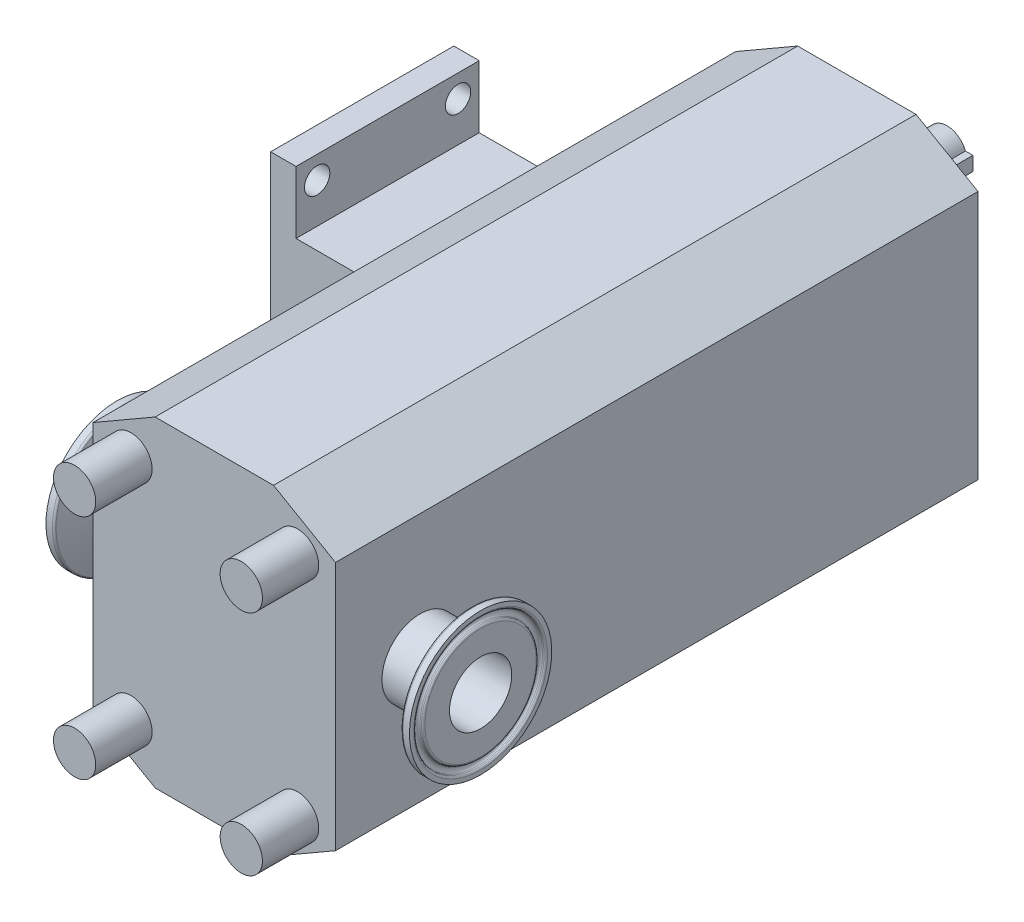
ISO-10303-21;
HEADER;
FILE_DESCRIPTION(('STEP AP214'),'2;1');
FILE_NAME('part.step','',(''),(''),'','','');
FILE_SCHEMA(('AUTOMOTIVE_DESIGN { 1 0 10303 214 1 1 1 1 }'));
ENDSEC;
DATA;
#1=APPLICATION_CONTEXT('core data for automotive mechanical design processes');
#2=APPLICATION_PROTOCOL_DEFINITION('international standard','automotive_design',2000,#1);
#3=PRODUCT_CONTEXT('',#1,'mechanical');
#4=PRODUCT('Part','Part','',(#3));
#5=PRODUCT_RELATED_PRODUCT_CATEGORY('part','',(#4));
#6=PRODUCT_DEFINITION_FORMATION('','',#4);
#7=PRODUCT_DEFINITION_CONTEXT('part definition',#1,'design');
#8=PRODUCT_DEFINITION('design','',#6,#7);
#9=PRODUCT_DEFINITION_SHAPE('','',#8);
#10=(LENGTH_UNIT() NAMED_UNIT(*) SI_UNIT(.MILLI.,.METRE.));
#11=(NAMED_UNIT(*) PLANE_ANGLE_UNIT() SI_UNIT($,.RADIAN.));
#12=(NAMED_UNIT(*) SI_UNIT($,.STERADIAN.) SOLID_ANGLE_UNIT());
#13=UNCERTAINTY_MEASURE_WITH_UNIT(LENGTH_MEASURE(1.E-05),#10,'distance_accuracy_value','');
#14=(GEOMETRIC_REPRESENTATION_CONTEXT(3) GLOBAL_UNCERTAINTY_ASSIGNED_CONTEXT((#13)) GLOBAL_UNIT_ASSIGNED_CONTEXT((#10,
#11,#12)) REPRESENTATION_CONTEXT('',''));
#15=CARTESIAN_POINT('',(0.,0.,0.));
#16=DIRECTION('',(0.,0.,1.));
#17=DIRECTION('',(1.,0.,0.));
#18=AXIS2_PLACEMENT_3D('',#15,#16,#17);
#19=CARTESIAN_POINT('',(64.4999999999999,22.8559616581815,191.534186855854));
#20=DIRECTION('',(1.,0.,0.));
#21=DIRECTION('',(0.,0.272211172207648,0.962237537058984));
#22=AXIS2_PLACEMENT_3D('',#19,#20,#21);
#23=PLANE('',#22);
#24=CARTESIAN_POINT('',(64.4999999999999,0.,198.));
#25=DIRECTION('',(1.,0.,0.));
#26=DIRECTION('',(0.,0.272211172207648,0.962237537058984));
#27=AXIS2_PLACEMENT_3D('',#24,#25,#26);
#28=CIRCLE('',#27,25.25);
#29=CARTESIAN_POINT('',(64.4999999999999,6.87333209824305,222.296497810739));
#30=VERTEX_POINT('',#29);
#31=EDGE_CURVE('P0_E10',#30,#30,#28,.T.);
#32=ORIENTED_EDGE('',*,*,#31,.T.);
#33=EDGE_LOOP('',(#32));
#34=FACE_BOUND('',#33,.T.);
#35=CARTESIAN_POINT('',(64.4999999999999,0.,198.));
#36=DIRECTION('',(1.,0.,0.));
#37=DIRECTION('',(0.,0.272211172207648,0.962237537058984));
#38=AXIS2_PLACEMENT_3D('',#35,#36,#37);
#39=CIRCLE('',#38,23.7529308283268);
#40=CARTESIAN_POINT('',(64.4999999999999,6.46581314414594,220.855961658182));
#41=VERTEX_POINT('',#40);
#42=EDGE_CURVE('P0_E61',#41,#41,#39,.T.);
#43=ORIENTED_EDGE('',*,*,#42,.F.);
#44=EDGE_LOOP('',(#43));
#45=FACE_BOUND('',#44,.T.);
#46=ADVANCED_FACE('P0_F15',(#34,#45),#23,.T.);
#47=CARTESIAN_POINT('',(72.,0.,198.));
#48=DIRECTION('',(1.,0.,0.));
#49=DIRECTION('',(0.,0.272211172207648,0.962237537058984));
#50=AXIS2_PLACEMENT_3D('',#47,#48,#49);
#51=CYLINDRICAL_SURFACE('',#50,25.25);
#52=CARTESIAN_POINT('',(62.2101660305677,0.,198.));
#53=DIRECTION('',(1.,0.,0.));
#54=DIRECTION('',(0.,0.272211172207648,0.962237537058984));
#55=AXIS2_PLACEMENT_3D('',#52,#53,#54);
#56=CIRCLE('',#55,25.25);
#57=CARTESIAN_POINT('',(62.2101660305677,6.87333209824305,222.296497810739));
#58=VERTEX_POINT('',#57);
#59=EDGE_CURVE('P0_E21',#58,#58,#56,.T.);
#60=ORIENTED_EDGE('',*,*,#59,.T.);
#61=EDGE_LOOP('',(#60));
#62=FACE_BOUND('',#61,.T.);
#63=ORIENTED_EDGE('',*,*,#31,.F.);
#64=EDGE_LOOP('',(#63));
#65=FACE_BOUND('',#64,.T.);
#66=ADVANCED_FACE('P0_F69',(#62,#65),#51,.T.);
#67=CARTESIAN_POINT('',(62.2101660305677,0.,198.));
#68=DIRECTION('',(1.,0.,0.));
#69=DIRECTION('',(0.,0.272211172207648,0.962237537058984));
#70=AXIS2_PLACEMENT_3D('',#67,#68,#69);
#71=TOROIDAL_SURFACE('',#70,24.45,0.799999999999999);
#72=CARTESIAN_POINT('',(61.458411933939,0.,198.));
#73=DIRECTION('',(1.,0.,0.));
#74=DIRECTION('',(0.,0.272211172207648,0.962237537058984));
#75=AXIS2_PLACEMENT_3D('',#72,#73,#74);
#76=CIRCLE('',#75,24.7236161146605);
#77=CARTESIAN_POINT('',(61.458411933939,6.73004452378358,221.789991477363));
#78=VERTEX_POINT('',#77);
#79=EDGE_CURVE('P0_E25',#78,#78,#76,.T.);
#80=ORIENTED_EDGE('',*,*,#79,.T.);
#81=EDGE_LOOP('',(#80));
#82=FACE_BOUND('',#81,.T.);
#83=ORIENTED_EDGE('',*,*,#59,.F.);
#84=EDGE_LOOP('',(#83));
#85=FACE_BOUND('',#84,.T.);
#86=ADVANCED_FACE('P0_F74',(#82,#85),#71,.T.);
#87=CARTESIAN_POINT('',(61.458411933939,0.,198.));
#88=DIRECTION('',(1.,0.,0.));
#89=DIRECTION('',(0.,0.272211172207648,0.962237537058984));
#90=AXIS2_PLACEMENT_3D('',#87,#88,#89);
#91=CONICAL_SURFACE('',#90,24.7236161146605,1.22173047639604);
#92=CARTESIAN_POINT('',(57.8523199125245,0.,198.));
#93=DIRECTION('',(1.,0.,0.));
#94=DIRECTION('',(0.,0.272211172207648,0.962237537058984));
#95=AXIS2_PLACEMENT_3D('',#92,#93,#94);
#96=CIRCLE('',#95,14.8159597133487);
#97=CARTESIAN_POINT('',(57.8523199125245,4.03306976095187,212.256472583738));
#98=VERTEX_POINT('',#97);
#99=EDGE_CURVE('P0_E29',#98,#98,#96,.T.);
#100=ORIENTED_EDGE('',*,*,#99,.T.);
#101=EDGE_LOOP('',(#100));
#102=FACE_BOUND('',#101,.T.);
#103=ORIENTED_EDGE('',*,*,#79,.F.);
#104=EDGE_LOOP('',(#103));
#105=FACE_BOUND('',#104,.T.);
#106=ADVANCED_FACE('P0_F78',(#102,#105),#91,.T.);
#107=CARTESIAN_POINT('',(55.9729346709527,0.,198.));
#108=DIRECTION('',(1.,0.,0.));
#109=DIRECTION('',(0.,0.272211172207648,0.962237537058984));
#110=AXIS2_PLACEMENT_3D('',#107,#108,#109);
#111=TOROIDAL_SURFACE('',#110,15.5,2.);
#112=CARTESIAN_POINT('',(55.9729346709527,0.,198.));
#113=DIRECTION('',(1.,0.,0.));
#114=DIRECTION('',(0.,0.272211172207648,0.962237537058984));
#115=AXIS2_PLACEMENT_3D('',#112,#113,#114);
#116=CIRCLE('',#115,13.5);
#117=CARTESIAN_POINT('',(55.9729346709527,3.67485082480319,210.990206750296));
#118=VERTEX_POINT('',#117);
#119=EDGE_CURVE('P0_E34',#118,#118,#116,.T.);
#120=ORIENTED_EDGE('',*,*,#119,.T.);
#121=EDGE_LOOP('',(#120));
#122=FACE_BOUND('',#121,.T.);
#123=ORIENTED_EDGE('',*,*,#99,.F.);
#124=EDGE_LOOP('',(#123));
#125=FACE_BOUND('',#124,.T.);
#126=ADVANCED_FACE('P0_F85',(#122,#125),#111,.F.);
#127=CARTESIAN_POINT('',(72.,0.,198.));
#128=DIRECTION('',(1.,0.,0.));
#129=DIRECTION('',(0.,0.272211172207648,0.962237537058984));
#130=AXIS2_PLACEMENT_3D('',#127,#128,#129);
#131=CYLINDRICAL_SURFACE('',#130,13.5);
#132=CARTESIAN_POINT('',(43.,0.,198.));
#133=DIRECTION('',(1.,0.,0.));
#134=DIRECTION('',(0.,0.272211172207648,0.962237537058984));
#135=AXIS2_PLACEMENT_3D('',#132,#133,#134);
#136=CIRCLE('',#135,13.5);
#137=CARTESIAN_POINT('',(43.,3.67485082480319,210.990206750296));
#138=VERTEX_POINT('',#137);
#139=EDGE_CURVE('P0_E37',#138,#138,#136,.T.);
#140=ORIENTED_EDGE('',*,*,#139,.T.);
#141=EDGE_LOOP('',(#140));
#142=FACE_BOUND('',#141,.T.);
#143=ORIENTED_EDGE('',*,*,#119,.F.);
#144=EDGE_LOOP('',(#143));
#145=FACE_BOUND('',#144,.T.);
#146=ADVANCED_FACE('P0_F89',(#142,#145),#131,.T.);
#147=CARTESIAN_POINT('',(43.,10.6327247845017,194.992066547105));
#148=DIRECTION('',(-1.,0.,0.));
#149=DIRECTION('',(0.,-0.272211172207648,-0.962237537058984));
#150=AXIS2_PLACEMENT_3D('',#147,#148,#149);
#151=PLANE('',#150);
#152=CARTESIAN_POINT('',(43.,0.,198.));
#153=DIRECTION('',(1.,0.,0.));
#154=DIRECTION('',(0.,0.272211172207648,0.962237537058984));
#155=AXIS2_PLACEMENT_3D('',#152,#153,#154);
#156=CIRCLE('',#155,11.05);
#157=CARTESIAN_POINT('',(43.,3.00793345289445,208.632724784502));
#158=VERTEX_POINT('',#157);
#159=EDGE_CURVE('P0_E40',#158,#158,#156,.T.);
#160=ORIENTED_EDGE('',*,*,#159,.T.);
#161=EDGE_LOOP('',(#160));
#162=FACE_BOUND('',#161,.T.);
#163=ORIENTED_EDGE('',*,*,#139,.F.);
#164=EDGE_LOOP('',(#163));
#165=FACE_BOUND('',#164,.T.);
#166=ADVANCED_FACE('P0_F93',(#162,#165),#151,.T.);
#167=CARTESIAN_POINT('',(72.,0.,198.));
#168=DIRECTION('',(1.,0.,0.));
#169=DIRECTION('',(0.,0.272211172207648,0.962237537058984));
#170=AXIS2_PLACEMENT_3D('',#167,#168,#169);
#171=CYLINDRICAL_SURFACE('',#170,11.05);
#172=CARTESIAN_POINT('',(64.4999999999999,0.,198.));
#173=DIRECTION('',(1.,0.,0.));
#174=DIRECTION('',(0.,0.272211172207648,0.962237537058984));
#175=AXIS2_PLACEMENT_3D('',#172,#173,#174);
#176=CIRCLE('',#175,11.05);
#177=CARTESIAN_POINT('',(64.4999999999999,3.00793345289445,208.632724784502));
#178=VERTEX_POINT('',#177);
#179=EDGE_CURVE('P0_E43',#178,#178,#176,.T.);
#180=ORIENTED_EDGE('',*,*,#179,.T.);
#181=EDGE_LOOP('',(#180));
#182=FACE_BOUND('',#181,.T.);
#183=ORIENTED_EDGE('',*,*,#159,.F.);
#184=EDGE_LOOP('',(#183));
#185=FACE_BOUND('',#184,.T.);
#186=ADVANCED_FACE('P0_F97',(#182,#185),#171,.F.);
#187=CARTESIAN_POINT('',(64.4999999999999,10.6327247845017,194.992066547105));
#188=DIRECTION('',(1.,0.,0.));
#189=DIRECTION('',(0.,0.272211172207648,0.962237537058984));
#190=AXIS2_PLACEMENT_3D('',#187,#188,#189);
#191=PLANE('',#190);
#192=CARTESIAN_POINT('',(64.4999999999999,0.,198.));
#193=DIRECTION('',(1.,0.,0.));
#194=DIRECTION('',(0.,0.272211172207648,0.962237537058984));
#195=AXIS2_PLACEMENT_3D('',#192,#193,#194);
#196=CIRCLE('',#195,19.7470691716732);
#197=CARTESIAN_POINT('',(64.4999999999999,5.37537284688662,217.001371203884));
#198=VERTEX_POINT('',#197);
#199=EDGE_CURVE('P0_E46',#198,#198,#196,.T.);
#200=ORIENTED_EDGE('',*,*,#199,.T.);
#201=EDGE_LOOP('',(#200));
#202=FACE_BOUND('',#201,.T.);
#203=ORIENTED_EDGE('',*,*,#179,.F.);
#204=EDGE_LOOP('',(#203));
#205=FACE_BOUND('',#204,.T.);
#206=ADVANCED_FACE('P0_F101',(#202,#205),#191,.T.);
#207=CARTESIAN_POINT('',(63.7,0.,198.));
#208=DIRECTION('',(1.,0.,0.));
#209=DIRECTION('',(0.,0.272211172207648,0.962237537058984));
#210=AXIS2_PLACEMENT_3D('',#207,#208,#209);
#211=TOROIDAL_SURFACE('',#210,19.7470691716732,0.8);
#212=CARTESIAN_POINT('',(64.0125849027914,0.,198.));
#213=DIRECTION('',(1.,0.,0.));
#214=DIRECTION('',(0.,0.272211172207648,0.962237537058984));
#215=AXIS2_PLACEMENT_3D('',#212,#213,#214);
#216=CIRCLE('',#215,20.4834730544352);
#217=CARTESIAN_POINT('',(64.0125849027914,5.57583021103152,217.709966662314));
#218=VERTEX_POINT('',#217);
#219=EDGE_CURVE('P0_E49',#218,#218,#216,.T.);
#220=ORIENTED_EDGE('',*,*,#219,.T.);
#221=EDGE_LOOP('',(#220));
#222=FACE_BOUND('',#221,.T.);
#223=ORIENTED_EDGE('',*,*,#199,.F.);
#224=EDGE_LOOP('',(#223));
#225=FACE_BOUND('',#224,.T.);
#226=ADVANCED_FACE('P0_F105',(#222,#225),#211,.T.);
#227=CARTESIAN_POINT('',(64.0125849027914,0.,198.));
#228=DIRECTION('',(-1.,0.,0.));
#229=DIRECTION('',(0.,-0.272211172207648,-0.962237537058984));
#230=AXIS2_PLACEMENT_3D('',#227,#228,#229);
#231=CONICAL_SURFACE('',#230,20.4834730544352,0.401425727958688);
#232=CARTESIAN_POINT('',(63.6311226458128,0.,198.));
#233=DIRECTION('',(1.,0.,0.));
#234=DIRECTION('',(0.,0.272211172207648,0.962237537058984));
#235=AXIS2_PLACEMENT_3D('',#232,#233,#234);
#236=CIRCLE('',#235,20.6453941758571);
#237=CARTESIAN_POINT('',(63.6311226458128,5.61990694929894,217.865773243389));
#238=VERTEX_POINT('',#237);
#239=EDGE_CURVE('P0_E52',#238,#238,#236,.T.);
#240=ORIENTED_EDGE('',*,*,#239,.T.);
#241=EDGE_LOOP('',(#240));
#242=FACE_BOUND('',#241,.T.);
#243=ORIENTED_EDGE('',*,*,#219,.F.);
#244=EDGE_LOOP('',(#243));
#245=FACE_BOUND('',#244,.T.);
#246=ADVANCED_FACE('P0_F109',(#242,#245),#231,.T.);
#247=CARTESIAN_POINT('',(64.0999999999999,0.,198.));
#248=DIRECTION('',(1.,0.,0.));
#249=DIRECTION('',(0.,0.272211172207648,0.962237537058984));
#250=AXIS2_PLACEMENT_3D('',#247,#248,#249);
#251=TOROIDAL_SURFACE('',#250,21.75,1.2);
#252=CARTESIAN_POINT('',(63.6311226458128,0.,198.));
#253=DIRECTION('',(1.,0.,0.));
#254=DIRECTION('',(0.,0.272211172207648,0.962237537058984));
#255=AXIS2_PLACEMENT_3D('',#252,#253,#254);
#256=CIRCLE('',#255,22.8546058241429);
#257=CARTESIAN_POINT('',(63.6311226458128,6.22127904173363,219.991559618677));
#258=VERTEX_POINT('',#257);
#259=EDGE_CURVE('P0_E55',#258,#258,#256,.T.);
#260=ORIENTED_EDGE('',*,*,#259,.T.);
#261=EDGE_LOOP('',(#260));
#262=FACE_BOUND('',#261,.T.);
#263=ORIENTED_EDGE('',*,*,#239,.F.);
#264=EDGE_LOOP('',(#263));
#265=FACE_BOUND('',#264,.T.);
#266=ADVANCED_FACE('P0_F113',(#262,#265),#251,.F.);
#267=CARTESIAN_POINT('',(63.6311226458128,0.,198.));
#268=DIRECTION('',(1.,0.,0.));
#269=DIRECTION('',(0.,0.272211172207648,0.962237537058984));
#270=AXIS2_PLACEMENT_3D('',#267,#268,#269);
#271=CONICAL_SURFACE('',#270,22.8546058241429,0.401425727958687);
#272=CARTESIAN_POINT('',(64.0125849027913,0.,198.));
#273=DIRECTION('',(1.,0.,0.));
#274=DIRECTION('',(0.,0.272211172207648,0.962237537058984));
#275=AXIS2_PLACEMENT_3D('',#272,#273,#274);
#276=CIRCLE('',#275,23.0165269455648);
#277=CARTESIAN_POINT('',(64.0125849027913,6.26535578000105,220.147366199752));
#278=VERTEX_POINT('',#277);
#279=EDGE_CURVE('P0_E58',#278,#278,#276,.T.);
#280=ORIENTED_EDGE('',*,*,#279,.T.);
#281=EDGE_LOOP('',(#280));
#282=FACE_BOUND('',#281,.T.);
#283=ORIENTED_EDGE('',*,*,#259,.F.);
#284=EDGE_LOOP('',(#283));
#285=FACE_BOUND('',#284,.T.);
#286=ADVANCED_FACE('P0_F117',(#282,#285),#271,.F.);
#287=CARTESIAN_POINT('',(63.7,0.,198.));
#288=DIRECTION('',(1.,0.,0.));
#289=DIRECTION('',(0.,0.272211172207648,0.962237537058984));
#290=AXIS2_PLACEMENT_3D('',#287,#288,#289);
#291=TOROIDAL_SURFACE('',#290,23.7529308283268,0.799999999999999);
#292=ORIENTED_EDGE('',*,*,#42,.T.);
#293=EDGE_LOOP('',(#292));
#294=FACE_BOUND('',#293,.T.);
#295=ORIENTED_EDGE('',*,*,#279,.F.);
#296=EDGE_LOOP('',(#295));
#297=FACE_BOUND('',#296,.T.);
#298=ADVANCED_FACE('P0_F65',(#294,#297),#291,.T.);
#299=CLOSED_SHELL('',(#46,#66,#86,#106,#126,#146,#166,#186,#206,#226,#246,#266,#286,#298));
#300=MANIFOLD_SOLID_BREP('P0_B1',#299);
#301=CARTESIAN_POINT('',(-43.,-44.2982940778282,228.));
#302=DIRECTION('',(1.,0.,0.));
#303=DIRECTION('',(0.,0.,-1.));
#304=AXIS2_PLACEMENT_3D('',#301,#302,#303);
#305=PLANE('',#304);
#306=DIRECTION('',(0.,-1.,0.));
#307=VECTOR('',#306,1.);
#308=CARTESIAN_POINT('',(-43.,-44.2982940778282,0.));
#309=LINE('',#308,#307);
#310=CARTESIAN_POINT('',(-43.,44.2982940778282,0.));
#311=VERTEX_POINT('',#310);
#312=CARTESIAN_POINT('',(-43.,-44.2982940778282,0.));
#313=VERTEX_POINT('',#312);
#314=EDGE_CURVE('P1_E290',#311,#313,#309,.T.);
#315=ORIENTED_EDGE('',*,*,#314,.T.);
#316=DIRECTION('',(0.,0.,-1.));
#317=VECTOR('',#316,1.);
#318=CARTESIAN_POINT('',(-43.,-44.2982940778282,228.));
#319=LINE('',#318,#317);
#320=CARTESIAN_POINT('',(-43.,-44.2982940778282,228.));
#321=VERTEX_POINT('',#320);
#322=EDGE_CURVE('P1_E320',#321,#313,#319,.T.);
#323=ORIENTED_EDGE('',*,*,#322,.F.);
#324=DIRECTION('',(0.,-1.,0.));
#325=VECTOR('',#324,1.);
#326=CARTESIAN_POINT('',(-43.,-44.2982940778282,228.));
#327=LINE('',#326,#325);
#328=CARTESIAN_POINT('',(-43.,44.2982940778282,228.));
#329=VERTEX_POINT('',#328);
#330=EDGE_CURVE('P1_E272',#329,#321,#327,.T.);
#331=ORIENTED_EDGE('',*,*,#330,.F.);
#332=DIRECTION('',(0.,0.,-1.));
#333=VECTOR('',#332,1.);
#334=CARTESIAN_POINT('',(-43.,44.2982940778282,228.));
#335=LINE('',#334,#333);
#336=EDGE_CURVE('P1_E323',#329,#311,#335,.T.);
#337=ORIENTED_EDGE('',*,*,#336,.T.);
#338=EDGE_LOOP('',(#315,#323,#331,#337));
#339=FACE_BOUND('',#338,.T.);
#340=CARTESIAN_POINT('',(-43.,0.,198.));
#341=DIRECTION('',(1.,0.,0.));
#342=DIRECTION('',(0.,1.,0.));
#343=AXIS2_PLACEMENT_3D('',#340,#341,#342);
#344=CIRCLE('',#343,11.2);
#345=CARTESIAN_POINT('',(-43.,11.2,198.));
#346=VERTEX_POINT('',#345);
#347=EDGE_CURVE('P1_E214',#346,#346,#344,.T.);
#348=ORIENTED_EDGE('',*,*,#347,.T.);
#349=EDGE_LOOP('',(#348));
#350=FACE_BOUND('',#349,.T.);
#351=DIRECTION('',(0.,-1.,0.));
#352=VECTOR('',#351,1.);
#353=CARTESIAN_POINT('',(-43.,-44.2982940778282,63.));
#354=LINE('',#353,#352);
#355=CARTESIAN_POINT('',(-43.,36.8601182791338,63.));
#356=VERTEX_POINT('',#355);
#357=CARTESIAN_POINT('',(-43.,-36.8601182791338,63.));
#358=VERTEX_POINT('',#357);
#359=EDGE_CURVE('P1_E11',#356,#358,#354,.T.);
#360=ORIENTED_EDGE('',*,*,#359,.F.);
#361=DIRECTION('',(0.,0.,-1.));
#362=VECTOR('',#361,1.);
#363=CARTESIAN_POINT('',(-43.,36.8601182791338,228.));
#364=LINE('',#363,#362);
#365=CARTESIAN_POINT('',(-43.,36.8601182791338,128.));
#366=VERTEX_POINT('',#365);
#367=EDGE_CURVE('P1_E570',#366,#356,#364,.T.);
#368=ORIENTED_EDGE('',*,*,#367,.F.);
#369=DIRECTION('',(0.,-1.,0.));
#370=VECTOR('',#369,1.);
#371=CARTESIAN_POINT('',(-43.,-44.2982940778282,128.));
#372=LINE('',#371,#370);
#373=CARTESIAN_POINT('',(-43.,-36.8601182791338,128.));
#374=VERTEX_POINT('',#373);
#375=EDGE_CURVE('P1_E343',#366,#374,#372,.T.);
#376=ORIENTED_EDGE('',*,*,#375,.T.);
#377=DIRECTION('',(0.,0.,1.));
#378=VECTOR('',#377,1.);
#379=CARTESIAN_POINT('',(-43.,-36.8601182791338,228.));
#380=LINE('',#379,#378);
#381=EDGE_CURVE('P1_E25',#358,#374,#380,.T.);
#382=ORIENTED_EDGE('',*,*,#381,.F.);
#383=EDGE_LOOP('',(#360,#368,#376,#382));
#384=FACE_BOUND('',#383,.T.);
#385=ADVANCED_FACE('P1_F17',(#339,#350,#384),#305,.F.);
#386=CARTESIAN_POINT('',(0.,20.,219.362441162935));
#387=DIRECTION('',(0.,0.,1.));
#388=DIRECTION('',(1.,0.,0.));
#389=AXIS2_PLACEMENT_3D('',#386,#387,#388);
#390=CYLINDRICAL_SURFACE('',#389,7.);
#391=CARTESIAN_POINT('',(0.,20.,-2.));
#392=DIRECTION('',(0.,0.,1.));
#393=DIRECTION('',(1.,0.,0.));
#394=AXIS2_PLACEMENT_3D('',#391,#392,#393);
#395=CIRCLE('',#394,7.);
#396=CARTESIAN_POINT('',(7.,20.,-2.));
#397=VERTEX_POINT('',#396);
#398=EDGE_CURVE('P1_E247',#397,#397,#395,.T.);
#399=ORIENTED_EDGE('',*,*,#398,.F.);
#400=EDGE_LOOP('',(#399));
#401=FACE_BOUND('',#400,.T.);
#402=DIRECTION('',(0.,0.,1.));
#403=VECTOR('',#402,1.);
#404=CARTESIAN_POINT('',(6.53834841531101,22.5,219.362441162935));
#405=LINE('',#404,#403);
#406=CARTESIAN_POINT('',(6.53834841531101,22.5,-32.));
#407=VERTEX_POINT('',#406);
#408=CARTESIAN_POINT('',(6.53834841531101,22.5,-17.));
#409=VERTEX_POINT('',#408);
#410=EDGE_CURVE('P1_E243',#407,#409,#405,.T.);
#411=ORIENTED_EDGE('',*,*,#410,.F.);
#412=CARTESIAN_POINT('',(0.,20.,-32.));
#413=DIRECTION('',(0.,0.,1.));
#414=DIRECTION('',(1.,0.,0.));
#415=AXIS2_PLACEMENT_3D('',#412,#413,#414);
#416=CIRCLE('',#415,7.);
#417=CARTESIAN_POINT('',(6.53834841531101,17.5,-32.));
#418=VERTEX_POINT('',#417);
#419=EDGE_CURVE('P1_E245',#407,#418,#416,.T.);
#420=ORIENTED_EDGE('',*,*,#419,.T.);
#421=DIRECTION('',(0.,0.,1.));
#422=VECTOR('',#421,1.);
#423=CARTESIAN_POINT('',(6.53834841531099,17.4999999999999,219.362441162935));
#424=LINE('',#423,#422);
#425=CARTESIAN_POINT('',(6.53834841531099,17.4999999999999,-17.));
#426=VERTEX_POINT('',#425);
#427=EDGE_CURVE('P1_E240',#426,#418,#424,.F.);
#428=ORIENTED_EDGE('',*,*,#427,.F.);
#429=CARTESIAN_POINT('',(7.,20.,-19.5));
#430=CARTESIAN_POINT('',(7.0000020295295,20.1358397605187,-19.5000028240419));
#431=CARTESIAN_POINT('',(6.99601056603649,20.2716594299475,-19.4888932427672));
#432=CARTESIAN_POINT('',(6.98048404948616,20.5392648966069,-19.444908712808));
#433=CARTESIAN_POINT('',(6.96894928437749,20.6710508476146,-19.4120345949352));
#434=CARTESIAN_POINT('',(6.93958109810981,20.9266921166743,-19.3258148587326));
#435=CARTESIAN_POINT('',(6.92175912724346,21.0505613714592,-19.2725064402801));
#436=CARTESIAN_POINT('',(6.88161078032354,21.287595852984,-19.1471112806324));
#437=CARTESIAN_POINT('',(6.85928332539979,21.4007585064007,-19.075020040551));
#438=CARTESIAN_POINT('',(6.81147377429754,21.6175880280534,-18.9111568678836));
#439=CARTESIAN_POINT('',(6.78590827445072,21.7207801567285,-18.8187812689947));
#440=CARTESIAN_POINT('',(6.73493522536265,21.9105819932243,-18.6182536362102));
#441=CARTESIAN_POINT('',(6.70952771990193,21.9971872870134,-18.5100974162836));
#442=CARTESIAN_POINT('',(6.6608007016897,22.1542373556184,-18.2766022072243));
#443=CARTESIAN_POINT('',(6.63758107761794,22.2240352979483,-18.1508052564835));
#444=CARTESIAN_POINT('',(6.59714352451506,22.3412757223,-17.8882963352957));
#445=CARTESIAN_POINT('',(6.57992345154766,22.3887261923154,-17.7515882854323));
#446=CARTESIAN_POINT('',(6.55432038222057,22.4580913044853,-17.4765771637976));
#447=CARTESIAN_POINT('',(6.54562733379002,22.4809051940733,-17.3385306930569));
#448=CARTESIAN_POINT('',(6.53715061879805,22.5031615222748,-17.0603163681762));
#449=CARTESIAN_POINT('',(6.53736369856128,22.5026124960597,-16.9201493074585));
#450=CARTESIAN_POINT('',(6.54640588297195,22.4788507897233,-16.6496443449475));
#451=CARTESIAN_POINT('',(6.55477363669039,22.4568516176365,-16.5191816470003));
#452=CARTESIAN_POINT('',(6.57842082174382,22.3928085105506,-16.2639384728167));
#453=CARTESIAN_POINT('',(6.59370119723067,22.3507618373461,-16.1391587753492));
#454=CARTESIAN_POINT('',(6.62975170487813,22.247095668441,-15.8962262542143));
#455=CARTESIAN_POINT('',(6.65061447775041,22.1851419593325,-15.7782303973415));
#456=CARTESIAN_POINT('',(6.69544469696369,22.0436527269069,-15.5539436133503));
#457=CARTESIAN_POINT('',(6.71941314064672,21.9641115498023,-15.4476564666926));
#458=CARTESIAN_POINT('',(6.76952498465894,21.784031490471,-15.2430404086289));
#459=CARTESIAN_POINT('',(6.7957122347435,21.6825133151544,-15.1455821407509));
#460=CARTESIAN_POINT('',(6.84605473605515,21.4642618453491,-14.9688283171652));
#461=CARTESIAN_POINT('',(6.87020973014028,21.3475266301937,-14.8895350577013));
#462=CARTESIAN_POINT('',(6.91416998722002,21.1001003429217,-14.7505193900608));
#463=CARTESIAN_POINT('',(6.93391532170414,20.9692491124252,-14.6910617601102));
#464=CARTESIAN_POINT('',(6.96639167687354,20.6985234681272,-14.5952841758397));
#465=CARTESIAN_POINT('',(6.97912551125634,20.5586526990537,-14.5589549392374));
#466=CARTESIAN_POINT('',(6.99566202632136,20.2812050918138,-14.5120808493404));
#467=CARTESIAN_POINT('',(6.99987103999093,20.1438506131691,-14.5003618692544));
#468=CARTESIAN_POINT('',(7.00012297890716,19.8690906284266,-14.4996548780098));
#469=CARTESIAN_POINT('',(6.99616751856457,19.7316851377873,-14.5106623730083));
#470=CARTESIAN_POINT('',(6.98080349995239,19.4656313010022,-14.5541861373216));
#471=CARTESIAN_POINT('',(6.96965417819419,19.3368441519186,-14.5859547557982));
#472=CARTESIAN_POINT('',(6.94128245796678,19.08650055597,-14.6691365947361));
#473=CARTESIAN_POINT('',(6.9240592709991,18.9649450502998,-14.7205523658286));
#474=CARTESIAN_POINT('',(6.88465739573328,18.728682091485,-14.8431588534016));
#475=CARTESIAN_POINT('',(6.86235262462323,18.6142645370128,-14.9148664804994));
#476=CARTESIAN_POINT('',(6.81528395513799,18.3987206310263,-15.0754274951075));
#477=CARTESIAN_POINT('',(6.79051921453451,18.2975988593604,-15.1642867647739));
#478=CARTESIAN_POINT('',(6.73966040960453,18.1059770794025,-15.3621296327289));
#479=CARTESIAN_POINT('',(6.71356479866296,18.0163131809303,-15.4719247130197));
#480=CARTESIAN_POINT('',(6.66427875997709,17.856544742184,-15.7055412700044));
#481=CARTESIAN_POINT('',(6.64108847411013,17.7864411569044,-15.8293634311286));
#482=CARTESIAN_POINT('',(6.60040332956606,17.6679131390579,-16.0880648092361));
#483=CARTESIAN_POINT('',(6.58291456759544,17.6195118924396,-16.2229556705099));
#484=CARTESIAN_POINT('',(6.55601442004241,17.5463858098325,-16.4997601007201));
#485=CARTESIAN_POINT('',(6.54659865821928,17.5216481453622,-16.6416698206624));
#486=CARTESIAN_POINT('',(6.53745596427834,17.4976374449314,-16.919520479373));
#487=CARTESIAN_POINT('',(6.53719306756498,17.4969557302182,-17.0553232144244));
#488=CARTESIAN_POINT('',(6.54503319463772,17.5175296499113,-17.3249976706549));
#489=CARTESIAN_POINT('',(6.55313556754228,17.5387835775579,-17.4588695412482));
#490=CARTESIAN_POINT('',(6.57636700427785,17.601569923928,-17.7175005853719));
#491=CARTESIAN_POINT('',(6.59131474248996,17.6425803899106,-17.8424040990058));
#492=CARTESIAN_POINT('',(6.62646329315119,17.7432735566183,-18.0836426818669));
#493=CARTESIAN_POINT('',(6.64666536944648,17.802960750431,-18.1999756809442));
#494=CARTESIAN_POINT('',(6.69127230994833,17.9426968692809,-18.4269257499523));
#495=CARTESIAN_POINT('',(6.71583400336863,18.0235962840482,-18.5369880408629));
#496=CARTESIAN_POINT('',(6.76580411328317,18.2020913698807,-18.7424275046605));
#497=CARTESIAN_POINT('',(6.79121278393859,18.2996920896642,-18.837800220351));
#498=CARTESIAN_POINT('',(6.84145445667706,18.5143374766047,-19.0157219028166));
#499=CARTESIAN_POINT('',(6.86620367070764,18.6320824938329,-19.0974530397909));
#500=CARTESIAN_POINT('',(6.91104924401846,18.8804886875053,-19.2399076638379));
#501=CARTESIAN_POINT('',(6.93114595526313,19.011148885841,-19.3006327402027));
#502=CARTESIAN_POINT('',(6.96446006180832,19.282353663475,-19.3991403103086));
#503=CARTESIAN_POINT('',(6.97764821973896,19.4229374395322,-19.4368254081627));
#504=CARTESIAN_POINT('',(6.99541542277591,19.7090231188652,-19.4872488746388));
#505=CARTESIAN_POINT('',(6.99999782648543,19.8545230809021,-19.4999969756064));
#506=CARTESIAN_POINT('',(7.,20.,-19.5));
#507=B_SPLINE_CURVE_WITH_KNOTS('',3,(#429,#430,#431,#432,#433,#434,#435,#436,#437,#438,#439,
#440,#441,#442,#443,#444,#445,#446,#447,#448,#449,#450,#451,#452,#453,#454,#455,#456,#457,#458,
#459,#460,#461,#462,#463,#464,#465,#466,#467,#468,#469,#470,#471,#472,#473,#474,#475,#476,#477,
#478,#479,#480,#481,#482,#483,#484,#485,#486,#487,#488,#489,#490,#491,#492,#493,#494,#495,#496,
#497,#498,#499,#500,#501,#502,#503,#504,#505,#506),.UNSPECIFIED.,.T.,.F.,(4,2,2,2,2,2,2,2,2,2,2,
2,2,2,2,2,2,2,2,2,2,2,2,2,2,2,2,2,2,2,2,2,2,2,2,2,2,2,4),(0.,0.406983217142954,
0.813950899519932,1.22018120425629,1.62650889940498,2.04714572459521,2.46789433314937,
2.90289606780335,3.3377421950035,3.75611562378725,4.17433620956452,4.57019246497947,
4.96610280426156,5.36904149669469,5.77210990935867,6.19956653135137,6.62707715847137,
7.06008524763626,7.49291944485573,7.90458529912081,8.31616976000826,8.71369326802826,
9.11126840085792,9.52005856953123,9.92898918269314,10.3593838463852,10.7897995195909,
11.2206739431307,11.6513146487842,12.0566930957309,12.4620400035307,12.8572208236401,
13.2524967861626,13.6670344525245,14.0816976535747,14.5159343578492,14.9501382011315,
15.3861650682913,15.8220217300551),.UNSPECIFIED.);
#508=EDGE_CURVE('P1_E40',#409,#426,#507,.T.);
#509=ORIENTED_EDGE('',*,*,#508,.F.);
#510=EDGE_LOOP('',(#411,#420,#428,#509));
#511=FACE_BOUND('',#510,.T.);
#512=ADVANCED_FACE('P1_F345',(#401,#511),#390,.T.);
#513=CARTESIAN_POINT('',(-119.726896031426,0.,0.));
#514=DIRECTION('',(0.,0.,-1.));
#515=DIRECTION('',(-1.,0.,0.));
#516=AXIS2_PLACEMENT_3D('',#513,#514,#515);
#517=PLANE('',#516);
#518=DIRECTION('',(-0.866025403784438,-0.500000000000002,0.));
#519=VECTOR('',#518,1.);
#520=CARTESIAN_POINT('',(-43.,44.2982940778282,0.));
#521=LINE('',#520,#519);
#522=CARTESIAN_POINT('',(-21.,57.,0.));
#523=VERTEX_POINT('',#522);
#524=EDGE_CURVE('P1_E268',#523,#311,#521,.T.);
#525=ORIENTED_EDGE('',*,*,#524,.F.);
#526=DIRECTION('',(-1.,0.,0.));
#527=VECTOR('',#526,1.);
#528=CARTESIAN_POINT('',(-21.,57.,0.));
#529=LINE('',#528,#527);
#530=CARTESIAN_POINT('',(21.,57.,0.));
#531=VERTEX_POINT('',#530);
#532=EDGE_CURVE('P1_E273',#531,#523,#529,.T.);
#533=ORIENTED_EDGE('',*,*,#532,.F.);
#534=DIRECTION('',(-0.866025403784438,0.500000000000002,0.));
#535=VECTOR('',#534,1.);
#536=CARTESIAN_POINT('',(21.,57.,0.));
#537=LINE('',#536,#535);
#538=CARTESIAN_POINT('',(43.,44.2982940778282,0.));
#539=VERTEX_POINT('',#538);
#540=EDGE_CURVE('P1_E300',#539,#531,#537,.T.);
#541=ORIENTED_EDGE('',*,*,#540,.F.);
#542=DIRECTION('',(0.,1.,0.));
#543=VECTOR('',#542,1.);
#544=CARTESIAN_POINT('',(42.9999999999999,-44.2982940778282,0.));
#545=LINE('',#544,#543);
#546=CARTESIAN_POINT('',(42.9999999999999,-44.2982940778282,0.));
#547=VERTEX_POINT('',#546);
#548=EDGE_CURVE('P1_E298',#547,#539,#545,.T.);
#549=ORIENTED_EDGE('',*,*,#548,.F.);
#550=DIRECTION('',(0.866025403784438,0.500000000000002,0.));
#551=VECTOR('',#550,1.);
#552=CARTESIAN_POINT('',(20.9999999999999,-57.,0.));
#553=LINE('',#552,#551);
#554=CARTESIAN_POINT('',(20.9999999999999,-57.,0.));
#555=VERTEX_POINT('',#554);
#556=EDGE_CURVE('P1_E296',#555,#547,#553,.T.);
#557=ORIENTED_EDGE('',*,*,#556,.F.);
#558=DIRECTION('',(1.,0.,0.));
#559=VECTOR('',#558,1.);
#560=CARTESIAN_POINT('',(-21.,-57.,0.));
#561=LINE('',#560,#559);
#562=CARTESIAN_POINT('',(-21.,-57.,0.));
#563=VERTEX_POINT('',#562);
#564=EDGE_CURVE('P1_E294',#563,#555,#561,.T.);
#565=ORIENTED_EDGE('',*,*,#564,.F.);
#566=DIRECTION('',(0.866025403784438,-0.500000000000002,0.));
#567=VECTOR('',#566,1.);
#568=CARTESIAN_POINT('',(-43.,-44.2982940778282,0.));
#569=LINE('',#568,#567);
#570=EDGE_CURVE('P1_E292',#313,#563,#569,.T.);
#571=ORIENTED_EDGE('',*,*,#570,.F.);
#572=ORIENTED_EDGE('',*,*,#314,.F.);
#573=EDGE_LOOP('',(#525,#533,#541,#549,#557,#565,#571,#572));
#574=FACE_BOUND('',#573,.T.);
#575=CARTESIAN_POINT('',(0.,20.,0.));
#576=DIRECTION('',(0.,0.,1.));
#577=DIRECTION('',(1.,0.,0.));
#578=AXIS2_PLACEMENT_3D('',#575,#576,#577);
#579=CIRCLE('',#578,10.);
#580=CARTESIAN_POINT('',(10.,20.,0.));
#581=VERTEX_POINT('',#580);
#582=EDGE_CURVE('P1_E253',#581,#581,#579,.T.);
#583=ORIENTED_EDGE('',*,*,#582,.T.);
#584=EDGE_LOOP('',(#583));
#585=FACE_BOUND('',#584,.T.);
#586=ADVANCED_FACE('P1_F378',(#574,#585),#517,.T.);
#587=CARTESIAN_POINT('',(-119.726896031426,0.,228.));
#588=DIRECTION('',(0.,0.,-1.));
#589=DIRECTION('',(-1.,0.,0.));
#590=AXIS2_PLACEMENT_3D('',#587,#588,#589);
#591=PLANE('',#590);
#592=CARTESIAN_POINT('',(29.5708036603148,-40.3888822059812,228.));
#593=DIRECTION('',(0.,0.,-1.));
#594=DIRECTION('',(-1.,0.,0.));
#595=AXIS2_PLACEMENT_3D('',#592,#593,#594);
#596=CIRCLE('',#595,7.5);
#597=CARTESIAN_POINT('',(22.0708036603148,-40.3888822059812,228.));
#598=VERTEX_POINT('',#597);
#599=EDGE_CURVE('P1_E332',#598,#598,#596,.F.);
#600=ORIENTED_EDGE('',*,*,#599,.F.);
#601=EDGE_LOOP('',(#600));
#602=FACE_BOUND('',#601,.T.);
#603=CARTESIAN_POINT('',(-29.5708036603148,40.3888822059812,228.));
#604=DIRECTION('',(0.,0.,-1.));
#605=DIRECTION('',(-1.,0.,0.));
#606=AXIS2_PLACEMENT_3D('',#603,#604,#605);
#607=CIRCLE('',#606,7.5);
#608=CARTESIAN_POINT('',(-37.0708036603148,40.3888822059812,228.));
#609=VERTEX_POINT('',#608);
#610=EDGE_CURVE('P1_E326',#609,#609,#607,.F.);
#611=ORIENTED_EDGE('',*,*,#610,.F.);
#612=EDGE_LOOP('',(#611));
#613=FACE_BOUND('',#612,.T.);
#614=DIRECTION('',(-0.866025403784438,-0.500000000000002,0.));
#615=VECTOR('',#614,1.);
#616=CARTESIAN_POINT('',(-43.,44.2982940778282,228.));
#617=LINE('',#616,#615);
#618=CARTESIAN_POINT('',(-21.,57.,228.));
#619=VERTEX_POINT('',#618);
#620=EDGE_CURVE('P1_E269',#619,#329,#617,.T.);
#621=ORIENTED_EDGE('',*,*,#620,.T.);
#622=ORIENTED_EDGE('',*,*,#330,.T.);
#623=DIRECTION('',(0.866025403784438,-0.500000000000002,0.));
#624=VECTOR('',#623,1.);
#625=CARTESIAN_POINT('',(-43.,-44.2982940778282,228.));
#626=LINE('',#625,#624);
#627=CARTESIAN_POINT('',(-21.,-57.,228.));
#628=VERTEX_POINT('',#627);
#629=EDGE_CURVE('P1_E275',#321,#628,#626,.T.);
#630=ORIENTED_EDGE('',*,*,#629,.T.);
#631=DIRECTION('',(1.,0.,0.));
#632=VECTOR('',#631,1.);
#633=CARTESIAN_POINT('',(-21.,-57.,228.));
#634=LINE('',#633,#632);
#635=CARTESIAN_POINT('',(20.9999999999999,-57.,228.));
#636=VERTEX_POINT('',#635);
#637=EDGE_CURVE('P1_E277',#628,#636,#634,.T.);
#638=ORIENTED_EDGE('',*,*,#637,.T.);
#639=DIRECTION('',(0.866025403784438,0.500000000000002,0.));
#640=VECTOR('',#639,1.);
#641=CARTESIAN_POINT('',(20.9999999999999,-57.,228.));
#642=LINE('',#641,#640);
#643=CARTESIAN_POINT('',(42.9999999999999,-44.2982940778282,228.));
#644=VERTEX_POINT('',#643);
#645=EDGE_CURVE('P1_E279',#636,#644,#642,.T.);
#646=ORIENTED_EDGE('',*,*,#645,.T.);
#647=DIRECTION('',(0.,1.,0.));
#648=VECTOR('',#647,1.);
#649=CARTESIAN_POINT('',(42.9999999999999,-44.2982940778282,228.));
#650=LINE('',#649,#648);
#651=CARTESIAN_POINT('',(43.,44.2982940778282,228.));
#652=VERTEX_POINT('',#651);
#653=EDGE_CURVE('P1_E281',#644,#652,#650,.T.);
#654=ORIENTED_EDGE('',*,*,#653,.T.);
#655=DIRECTION('',(-0.866025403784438,0.500000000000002,0.));
#656=VECTOR('',#655,1.);
#657=CARTESIAN_POINT('',(21.,57.,228.));
#658=LINE('',#657,#656);
#659=CARTESIAN_POINT('',(21.,57.,228.));
#660=VERTEX_POINT('',#659);
#661=EDGE_CURVE('P1_E283',#652,#660,#658,.T.);
#662=ORIENTED_EDGE('',*,*,#661,.T.);
#663=DIRECTION('',(-1.,0.,0.));
#664=VECTOR('',#663,1.);
#665=CARTESIAN_POINT('',(-21.,57.,228.));
#666=LINE('',#665,#664);
#667=EDGE_CURVE('P1_E285',#660,#619,#666,.T.);
#668=ORIENTED_EDGE('',*,*,#667,.T.);
#669=EDGE_LOOP('',(#621,#622,#630,#638,#646,#654,#662,#668));
#670=FACE_BOUND('',#669,.T.);
#671=CARTESIAN_POINT('',(29.5708036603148,40.3888822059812,228.));
#672=DIRECTION('',(0.,0.,-1.));
#673=DIRECTION('',(-1.,0.,0.));
#674=AXIS2_PLACEMENT_3D('',#671,#672,#673);
#675=CIRCLE('',#674,7.5);
#676=CARTESIAN_POINT('',(22.0708036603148,40.3888822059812,228.));
#677=VERTEX_POINT('',#676);
#678=EDGE_CURVE('P1_E329',#677,#677,#675,.F.);
#679=ORIENTED_EDGE('',*,*,#678,.F.);
#680=EDGE_LOOP('',(#679));
#681=FACE_BOUND('',#680,.T.);
#682=CARTESIAN_POINT('',(-29.5708036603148,-40.3888822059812,228.));
#683=DIRECTION('',(0.,0.,-1.));
#684=DIRECTION('',(-1.,0.,0.));
#685=AXIS2_PLACEMENT_3D('',#682,#683,#684);
#686=CIRCLE('',#685,7.5);
#687=CARTESIAN_POINT('',(-37.0708036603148,-40.3888822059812,228.));
#688=VERTEX_POINT('',#687);
#689=EDGE_CURVE('P1_E335',#688,#688,#686,.F.);
#690=ORIENTED_EDGE('',*,*,#689,.F.);
#691=EDGE_LOOP('',(#690));
#692=FACE_BOUND('',#691,.T.);
#693=ADVANCED_FACE('P1_F409',(#602,#613,#670,#681,#692),#591,.F.);
#694=CARTESIAN_POINT('',(-43.,44.2982940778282,228.));
#695=DIRECTION('',(0.500000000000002,-0.866025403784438,0.));
#696=DIRECTION('',(0.866025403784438,0.500000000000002,0.));
#697=AXIS2_PLACEMENT_3D('',#694,#695,#696);
#698=PLANE('',#697);
#699=ORIENTED_EDGE('',*,*,#524,.T.);
#700=ORIENTED_EDGE('',*,*,#336,.F.);
#701=ORIENTED_EDGE('',*,*,#620,.F.);
#702=DIRECTION('',(0.,0.,-1.));
#703=VECTOR('',#702,1.);
#704=CARTESIAN_POINT('',(-21.,57.,228.));
#705=LINE('',#704,#703);
#706=EDGE_CURVE('P1_E287',#619,#523,#705,.T.);
#707=ORIENTED_EDGE('',*,*,#706,.T.);
#708=EDGE_LOOP('',(#699,#700,#701,#707));
#709=FACE_BOUND('',#708,.T.);
#710=ADVANCED_FACE('P1_F19',(#709),#698,.F.);
#711=CARTESIAN_POINT('',(-43.,-44.2982940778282,228.));
#712=DIRECTION('',(0.500000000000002,0.866025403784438,0.));
#713=DIRECTION('',(-0.866025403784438,0.500000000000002,0.));
#714=AXIS2_PLACEMENT_3D('',#711,#712,#713);
#715=PLANE('',#714);
#716=ORIENTED_EDGE('',*,*,#570,.T.);
#717=DIRECTION('',(0.,0.,-1.));
#718=VECTOR('',#717,1.);
#719=CARTESIAN_POINT('',(-21.,-57.,228.));
#720=LINE('',#719,#718);
#721=EDGE_CURVE('P1_E317',#628,#563,#720,.T.);
#722=ORIENTED_EDGE('',*,*,#721,.F.);
#723=ORIENTED_EDGE('',*,*,#629,.F.);
#724=ORIENTED_EDGE('',*,*,#322,.T.);
#725=EDGE_LOOP('',(#716,#722,#723,#724));
#726=FACE_BOUND('',#725,.T.);
#727=ADVANCED_FACE('P1_F382',(#726),#715,.F.);
#728=CARTESIAN_POINT('',(-21.,-57.,228.));
#729=DIRECTION('',(0.,1.,0.));
#730=DIRECTION('',(0.,0.,1.));
#731=AXIS2_PLACEMENT_3D('',#728,#729,#730);
#732=PLANE('',#731);
#733=ORIENTED_EDGE('',*,*,#564,.T.);
#734=DIRECTION('',(0.,0.,-1.));
#735=VECTOR('',#734,1.);
#736=CARTESIAN_POINT('',(20.9999999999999,-57.,228.));
#737=LINE('',#736,#735);
#738=EDGE_CURVE('P1_E314',#636,#555,#737,.T.);
#739=ORIENTED_EDGE('',*,*,#738,.F.);
#740=ORIENTED_EDGE('',*,*,#637,.F.);
#741=ORIENTED_EDGE('',*,*,#721,.T.);
#742=EDGE_LOOP('',(#733,#739,#740,#741));
#743=FACE_BOUND('',#742,.T.);
#744=ADVANCED_FACE('P1_F385',(#743),#732,.F.);
#745=CARTESIAN_POINT('',(20.9999999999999,-57.,228.));
#746=DIRECTION('',(-0.500000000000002,0.866025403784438,0.));
#747=DIRECTION('',(-0.866025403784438,-0.500000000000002,0.));
#748=AXIS2_PLACEMENT_3D('',#745,#746,#747);
#749=PLANE('',#748);
#750=ORIENTED_EDGE('',*,*,#556,.T.);
#751=DIRECTION('',(0.,0.,-1.));
#752=VECTOR('',#751,1.);
#753=CARTESIAN_POINT('',(42.9999999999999,-44.2982940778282,228.));
#754=LINE('',#753,#752);
#755=EDGE_CURVE('P1_E311',#644,#547,#754,.T.);
#756=ORIENTED_EDGE('',*,*,#755,.F.);
#757=ORIENTED_EDGE('',*,*,#645,.F.);
#758=ORIENTED_EDGE('',*,*,#738,.T.);
#759=EDGE_LOOP('',(#750,#756,#757,#758));
#760=FACE_BOUND('',#759,.T.);
#761=ADVANCED_FACE('P1_F389',(#760),#749,.F.);
#762=CARTESIAN_POINT('',(42.9999999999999,-44.2982940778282,228.));
#763=DIRECTION('',(-1.,0.,0.));
#764=DIRECTION('',(0.,-1.,0.));
#765=AXIS2_PLACEMENT_3D('',#762,#763,#764);
#766=PLANE('',#765);
#767=CARTESIAN_POINT('',(43.,0.,198.));
#768=DIRECTION('',(1.,0.,0.));
#769=DIRECTION('',(0.,1.,0.));
#770=AXIS2_PLACEMENT_3D('',#767,#768,#769);
#771=CIRCLE('',#770,11.2);
#772=CARTESIAN_POINT('',(43.,11.1999999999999,198.));
#773=VERTEX_POINT('',#772);
#774=EDGE_CURVE('P1_E168',#773,#773,#771,.T.);
#775=ORIENTED_EDGE('',*,*,#774,.F.);
#776=EDGE_LOOP('',(#775));
#777=FACE_BOUND('',#776,.T.);
#778=ORIENTED_EDGE('',*,*,#548,.T.);
#779=DIRECTION('',(0.,0.,-1.));
#780=VECTOR('',#779,1.);
#781=CARTESIAN_POINT('',(43.,44.2982940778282,228.));
#782=LINE('',#781,#780);
#783=EDGE_CURVE('P1_E308',#652,#539,#782,.T.);
#784=ORIENTED_EDGE('',*,*,#783,.F.);
#785=ORIENTED_EDGE('',*,*,#653,.F.);
#786=ORIENTED_EDGE('',*,*,#755,.T.);
#787=EDGE_LOOP('',(#778,#784,#785,#786));
#788=FACE_BOUND('',#787,.T.);
#789=ADVANCED_FACE('P1_F393',(#777,#788),#766,.F.);
#790=CARTESIAN_POINT('',(21.,57.,228.));
#791=DIRECTION('',(-0.500000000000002,-0.866025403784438,0.));
#792=DIRECTION('',(0.866025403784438,-0.500000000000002,0.));
#793=AXIS2_PLACEMENT_3D('',#790,#791,#792);
#794=PLANE('',#793);
#795=ORIENTED_EDGE('',*,*,#540,.T.);
#796=DIRECTION('',(0.,0.,-1.));
#797=VECTOR('',#796,1.);
#798=CARTESIAN_POINT('',(21.,57.,228.));
#799=LINE('',#798,#797);
#800=EDGE_CURVE('P1_E305',#660,#531,#799,.T.);
#801=ORIENTED_EDGE('',*,*,#800,.F.);
#802=ORIENTED_EDGE('',*,*,#661,.F.);
#803=ORIENTED_EDGE('',*,*,#783,.T.);
#804=EDGE_LOOP('',(#795,#801,#802,#803));
#805=FACE_BOUND('',#804,.T.);
#806=ADVANCED_FACE('P1_F397',(#805),#794,.F.);
#807=CARTESIAN_POINT('',(-21.,57.,228.));
#808=DIRECTION('',(0.,-1.,0.));
#809=DIRECTION('',(0.,0.,-1.));
#810=AXIS2_PLACEMENT_3D('',#807,#808,#809);
#811=PLANE('',#810);
#812=ORIENTED_EDGE('',*,*,#532,.T.);
#813=ORIENTED_EDGE('',*,*,#706,.F.);
#814=ORIENTED_EDGE('',*,*,#667,.F.);
#815=ORIENTED_EDGE('',*,*,#800,.T.);
#816=EDGE_LOOP('',(#812,#813,#814,#815));
#817=FACE_BOUND('',#816,.T.);
#818=ADVANCED_FACE('P1_F401',(#817),#811,.F.);
#819=CARTESIAN_POINT('',(-29.5708036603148,40.3888822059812,248.));
#820=DIRECTION('',(0.,0.,-1.));
#821=DIRECTION('',(-1.,0.,0.));
#822=AXIS2_PLACEMENT_3D('',#819,#820,#821);
#823=CYLINDRICAL_SURFACE('',#822,7.5);
#824=CARTESIAN_POINT('',(-29.5708036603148,40.3888822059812,248.));
#825=DIRECTION('',(0.,0.,1.));
#826=DIRECTION('',(1.,0.,0.));
#827=AXIS2_PLACEMENT_3D('',#824,#825,#826);
#828=CIRCLE('',#827,7.5);
#829=CARTESIAN_POINT('',(-22.0708036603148,40.3888822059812,248.));
#830=VERTEX_POINT('',#829);
#831=EDGE_CURVE('P1_E265',#830,#830,#828,.T.);
#832=ORIENTED_EDGE('',*,*,#831,.F.);
#833=EDGE_LOOP('',(#832));
#834=FACE_BOUND('',#833,.T.);
#835=ORIENTED_EDGE('',*,*,#610,.T.);
#836=EDGE_LOOP('',(#835));
#837=FACE_BOUND('',#836,.T.);
#838=ADVANCED_FACE('P1_F405',(#834,#837),#823,.T.);
#839=CARTESIAN_POINT('',(-29.5708036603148,40.3888822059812,248.));
#840=DIRECTION('',(0.,0.,1.));
#841=DIRECTION('',(1.,0.,0.));
#842=AXIS2_PLACEMENT_3D('',#839,#840,#841);
#843=PLANE('',#842);
#844=ORIENTED_EDGE('',*,*,#831,.T.);
#845=EDGE_LOOP('',(#844));
#846=FACE_BOUND('',#845,.T.);
#847=ADVANCED_FACE('P1_F416',(#846),#843,.T.);
#848=CARTESIAN_POINT('',(29.5708036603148,40.3888822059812,248.));
#849=DIRECTION('',(0.,0.,-1.));
#850=DIRECTION('',(-1.,0.,0.));
#851=AXIS2_PLACEMENT_3D('',#848,#849,#850);
#852=CYLINDRICAL_SURFACE('',#851,7.5);
#853=CARTESIAN_POINT('',(29.5708036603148,40.3888822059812,248.));
#854=DIRECTION('',(0.,0.,1.));
#855=DIRECTION('',(1.,0.,0.));
#856=AXIS2_PLACEMENT_3D('',#853,#854,#855);
#857=CIRCLE('',#856,7.5);
#858=CARTESIAN_POINT('',(37.0708036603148,40.3888822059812,248.));
#859=VERTEX_POINT('',#858);
#860=EDGE_CURVE('P1_E262',#859,#859,#857,.T.);
#861=ORIENTED_EDGE('',*,*,#860,.F.);
#862=EDGE_LOOP('',(#861));
#863=FACE_BOUND('',#862,.T.);
#864=ORIENTED_EDGE('',*,*,#678,.T.);
#865=EDGE_LOOP('',(#864));
#866=FACE_BOUND('',#865,.T.);
#867=ADVANCED_FACE('P1_F420',(#863,#866),#852,.T.);
#868=CARTESIAN_POINT('',(29.5708036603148,40.3888822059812,248.));
#869=DIRECTION('',(0.,0.,1.));
#870=DIRECTION('',(1.,0.,0.));
#871=AXIS2_PLACEMENT_3D('',#868,#869,#870);
#872=PLANE('',#871);
#873=ORIENTED_EDGE('',*,*,#860,.T.);
#874=EDGE_LOOP('',(#873));
#875=FACE_BOUND('',#874,.T.);
#876=ADVANCED_FACE('P1_F424',(#875),#872,.T.);
#877=CARTESIAN_POINT('',(29.5708036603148,-40.3888822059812,248.));
#878=DIRECTION('',(0.,0.,-1.));
#879=DIRECTION('',(-1.,0.,0.));
#880=AXIS2_PLACEMENT_3D('',#877,#878,#879);
#881=CYLINDRICAL_SURFACE('',#880,7.5);
#882=CARTESIAN_POINT('',(29.5708036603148,-40.3888822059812,248.));
#883=DIRECTION('',(0.,0.,1.));
#884=DIRECTION('',(1.,0.,0.));
#885=AXIS2_PLACEMENT_3D('',#882,#883,#884);
#886=CIRCLE('',#885,7.5);
#887=CARTESIAN_POINT('',(37.0708036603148,-40.3888822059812,248.));
#888=VERTEX_POINT('',#887);
#889=EDGE_CURVE('P1_E259',#888,#888,#886,.T.);
#890=ORIENTED_EDGE('',*,*,#889,.F.);
#891=EDGE_LOOP('',(#890));
#892=FACE_BOUND('',#891,.T.);
#893=ORIENTED_EDGE('',*,*,#599,.T.);
#894=EDGE_LOOP('',(#893));
#895=FACE_BOUND('',#894,.T.);
#896=ADVANCED_FACE('P1_F428',(#892,#895),#881,.T.);
#897=CARTESIAN_POINT('',(29.5708036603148,-40.3888822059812,248.));
#898=DIRECTION('',(0.,0.,1.));
#899=DIRECTION('',(1.,0.,0.));
#900=AXIS2_PLACEMENT_3D('',#897,#898,#899);
#901=PLANE('',#900);
#902=ORIENTED_EDGE('',*,*,#889,.T.);
#903=EDGE_LOOP('',(#902));
#904=FACE_BOUND('',#903,.T.);
#905=ADVANCED_FACE('P1_F432',(#904),#901,.T.);
#906=CARTESIAN_POINT('',(-29.5708036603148,-40.3888822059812,248.));
#907=DIRECTION('',(0.,0.,-1.));
#908=DIRECTION('',(-1.,0.,0.));
#909=AXIS2_PLACEMENT_3D('',#906,#907,#908);
#910=CYLINDRICAL_SURFACE('',#909,7.5);
#911=CARTESIAN_POINT('',(-29.5708036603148,-40.3888822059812,248.));
#912=DIRECTION('',(0.,0.,1.));
#913=DIRECTION('',(1.,0.,0.));
#914=AXIS2_PLACEMENT_3D('',#911,#912,#913);
#915=CIRCLE('',#914,7.5);
#916=CARTESIAN_POINT('',(-22.0708036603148,-40.3888822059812,248.));
#917=VERTEX_POINT('',#916);
#918=EDGE_CURVE('P1_E256',#917,#917,#915,.T.);
#919=ORIENTED_EDGE('',*,*,#918,.F.);
#920=EDGE_LOOP('',(#919));
#921=FACE_BOUND('',#920,.T.);
#922=ORIENTED_EDGE('',*,*,#689,.T.);
#923=EDGE_LOOP('',(#922));
#924=FACE_BOUND('',#923,.T.);
#925=ADVANCED_FACE('P1_F436',(#921,#924),#910,.T.);
#926=CARTESIAN_POINT('',(-29.5708036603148,-40.3888822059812,248.));
#927=DIRECTION('',(0.,0.,1.));
#928=DIRECTION('',(1.,0.,0.));
#929=AXIS2_PLACEMENT_3D('',#926,#927,#928);
#930=PLANE('',#929);
#931=ORIENTED_EDGE('',*,*,#918,.T.);
#932=EDGE_LOOP('',(#931));
#933=FACE_BOUND('',#932,.T.);
#934=ADVANCED_FACE('P1_F440',(#933),#930,.T.);
#935=CARTESIAN_POINT('',(0.,20.,219.362441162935));
#936=DIRECTION('',(0.,0.,1.));
#937=DIRECTION('',(1.,0.,0.));
#938=AXIS2_PLACEMENT_3D('',#935,#936,#937);
#939=CYLINDRICAL_SURFACE('',#938,10.);
#940=ORIENTED_EDGE('',*,*,#582,.F.);
#941=EDGE_LOOP('',(#940));
#942=FACE_BOUND('',#941,.T.);
#943=CARTESIAN_POINT('',(0.,20.,-2.));
#944=DIRECTION('',(0.,0.,1.));
#945=DIRECTION('',(1.,0.,0.));
#946=AXIS2_PLACEMENT_3D('',#943,#944,#945);
#947=CIRCLE('',#946,10.);
#948=CARTESIAN_POINT('',(10.,20.,-2.));
#949=VERTEX_POINT('',#948);
#950=EDGE_CURVE('P1_E250',#949,#949,#947,.T.);
#951=ORIENTED_EDGE('',*,*,#950,.T.);
#952=EDGE_LOOP('',(#951));
#953=FACE_BOUND('',#952,.T.);
#954=ADVANCED_FACE('P1_F369',(#942,#953),#939,.T.);
#955=CARTESIAN_POINT('',(0.,30.,-2.));
#956=DIRECTION('',(0.,0.,1.));
#957=DIRECTION('',(1.,0.,0.));
#958=AXIS2_PLACEMENT_3D('',#955,#956,#957);
#959=PLANE('',#958);
#960=ORIENTED_EDGE('',*,*,#950,.F.);
#961=EDGE_LOOP('',(#960));
#962=FACE_BOUND('',#961,.T.);
#963=ORIENTED_EDGE('',*,*,#398,.T.);
#964=EDGE_LOOP('',(#963));
#965=FACE_BOUND('',#964,.T.);
#966=ADVANCED_FACE('P1_F362',(#962,#965),#959,.F.);
#967=CARTESIAN_POINT('',(0.,27.,-32.));
#968=DIRECTION('',(0.,0.,1.));
#969=DIRECTION('',(1.,0.,0.));
#970=AXIS2_PLACEMENT_3D('',#967,#968,#969);
#971=PLANE('',#970);
#972=ORIENTED_EDGE('',*,*,#419,.F.);
#973=DIRECTION('',(-1.,0.,0.));
#974=VECTOR('',#973,1.);
#975=CARTESIAN_POINT('',(9.2,22.5,-32.));
#976=LINE('',#975,#974);
#977=CARTESIAN_POINT('',(9.2,22.5,-32.));
#978=VERTEX_POINT('',#977);
#979=EDGE_CURVE('P1_E237',#978,#407,#976,.T.);
#980=ORIENTED_EDGE('',*,*,#979,.F.);
#981=DIRECTION('',(0.,1.,0.));
#982=VECTOR('',#981,1.);
#983=CARTESIAN_POINT('',(9.2,22.5,-32.));
#984=LINE('',#983,#982);
#985=CARTESIAN_POINT('',(9.2,17.5,-32.));
#986=VERTEX_POINT('',#985);
#987=EDGE_CURVE('P1_E217',#986,#978,#984,.T.);
#988=ORIENTED_EDGE('',*,*,#987,.F.);
#989=DIRECTION('',(-1.,0.,0.));
#990=VECTOR('',#989,1.);
#991=CARTESIAN_POINT('',(9.2,17.5,-32.));
#992=LINE('',#991,#990);
#993=EDGE_CURVE('P1_E228',#986,#418,#992,.T.);
#994=ORIENTED_EDGE('',*,*,#993,.T.);
#995=EDGE_LOOP('',(#972,#980,#988,#994));
#996=FACE_BOUND('',#995,.T.);
#997=ADVANCED_FACE('P1_F355',(#996),#971,.F.);
#998=CARTESIAN_POINT('',(9.2,20.,-17.));
#999=DIRECTION('',(-1.,0.,0.));
#1000=DIRECTION('',(0.,0.,1.));
#1001=AXIS2_PLACEMENT_3D('',#998,#999,#1000);
#1002=CYLINDRICAL_SURFACE('',#1001,2.5);
#1003=DIRECTION('',(-1.,0.,0.));
#1004=VECTOR('',#1003,1.);
#1005=CARTESIAN_POINT('',(9.2,22.5,-17.));
#1006=LINE('',#1005,#1004);
#1007=CARTESIAN_POINT('',(9.2,22.5,-17.));
#1008=VERTEX_POINT('',#1007);
#1009=EDGE_CURVE('P1_E234',#1008,#409,#1006,.T.);
#1010=ORIENTED_EDGE('',*,*,#1009,.T.);
#1011=ORIENTED_EDGE('',*,*,#508,.T.);
#1012=DIRECTION('',(-1.,0.,0.));
#1013=VECTOR('',#1012,1.);
#1014=CARTESIAN_POINT('',(9.2,17.5,-17.));
#1015=LINE('',#1014,#1013);
#1016=CARTESIAN_POINT('',(9.2,17.5,-17.));
#1017=VERTEX_POINT('',#1016);
#1018=EDGE_CURVE('P1_E231',#1017,#426,#1015,.T.);
#1019=ORIENTED_EDGE('',*,*,#1018,.F.);
#1020=CARTESIAN_POINT('',(9.2,20.,-17.));
#1021=DIRECTION('',(1.,0.,0.));
#1022=DIRECTION('',(0.,0.,-1.));
#1023=AXIS2_PLACEMENT_3D('',#1020,#1021,#1022);
#1024=CIRCLE('',#1023,2.5);
#1025=EDGE_CURVE('P1_E224',#1008,#1017,#1024,.T.);
#1026=ORIENTED_EDGE('',*,*,#1025,.F.);
#1027=EDGE_LOOP('',(#1010,#1011,#1019,#1026));
#1028=FACE_BOUND('',#1027,.T.);
#1029=ADVANCED_FACE('P1_F349',(#1028),#1002,.T.);
#1030=CARTESIAN_POINT('',(9.2,22.5,-32.));
#1031=DIRECTION('',(0.,-1.,0.));
#1032=DIRECTION('',(0.,0.,-1.));
#1033=AXIS2_PLACEMENT_3D('',#1030,#1031,#1032);
#1034=PLANE('',#1033);
#1035=ORIENTED_EDGE('',*,*,#979,.T.);
#1036=ORIENTED_EDGE('',*,*,#410,.T.);
#1037=ORIENTED_EDGE('',*,*,#1009,.F.);
#1038=DIRECTION('',(0.,0.,1.));
#1039=VECTOR('',#1038,1.);
#1040=CARTESIAN_POINT('',(9.2,22.5,-32.));
#1041=LINE('',#1040,#1039);
#1042=EDGE_CURVE('P1_E222',#978,#1008,#1041,.T.);
#1043=ORIENTED_EDGE('',*,*,#1042,.F.);
#1044=EDGE_LOOP('',(#1035,#1036,#1037,#1043));
#1045=FACE_BOUND('',#1044,.T.);
#1046=ADVANCED_FACE('P1_F354',(#1045),#1034,.F.);
#1047=CARTESIAN_POINT('',(9.2,17.5,-32.));
#1048=DIRECTION('',(0.,1.,0.));
#1049=DIRECTION('',(0.,0.,1.));
#1050=AXIS2_PLACEMENT_3D('',#1047,#1048,#1049);
#1051=PLANE('',#1050);
#1052=ORIENTED_EDGE('',*,*,#1018,.T.);
#1053=ORIENTED_EDGE('',*,*,#427,.T.);
#1054=ORIENTED_EDGE('',*,*,#993,.F.);
#1055=DIRECTION('',(0.,0.,-1.));
#1056=VECTOR('',#1055,1.);
#1057=CARTESIAN_POINT('',(9.2,17.5,-32.));
#1058=LINE('',#1057,#1056);
#1059=EDGE_CURVE('P1_E226',#1017,#986,#1058,.T.);
#1060=ORIENTED_EDGE('',*,*,#1059,.F.);
#1061=EDGE_LOOP('',(#1052,#1053,#1054,#1060));
#1062=FACE_BOUND('',#1061,.T.);
#1063=ADVANCED_FACE('P1_F357',(#1062),#1051,.F.);
#1064=CARTESIAN_POINT('',(9.2,20.,-17.));
#1065=DIRECTION('',(1.,0.,0.));
#1066=DIRECTION('',(0.,0.,-1.));
#1067=AXIS2_PLACEMENT_3D('',#1064,#1065,#1066);
#1068=PLANE('',#1067);
#1069=ORIENTED_EDGE('',*,*,#987,.T.);
#1070=ORIENTED_EDGE('',*,*,#1042,.T.);
#1071=ORIENTED_EDGE('',*,*,#1025,.T.);
#1072=ORIENTED_EDGE('',*,*,#1059,.T.);
#1073=EDGE_LOOP('',(#1069,#1070,#1071,#1072));
#1074=FACE_BOUND('',#1073,.T.);
#1075=ADVANCED_FACE('P1_F461',(#1074),#1068,.T.);
#1076=CARTESIAN_POINT('',(-43.,0.,198.));
#1077=DIRECTION('',(1.,0.,0.));
#1078=DIRECTION('',(0.,1.,0.));
#1079=AXIS2_PLACEMENT_3D('',#1076,#1077,#1078);
#1080=CYLINDRICAL_SURFACE('',#1079,11.2);
#1081=ORIENTED_EDGE('',*,*,#347,.F.);
#1082=EDGE_LOOP('',(#1081));
#1083=FACE_BOUND('',#1082,.T.);
#1084=ORIENTED_EDGE('',*,*,#774,.T.);
#1085=EDGE_LOOP('',(#1084));
#1086=FACE_BOUND('',#1085,.T.);
#1087=ADVANCED_FACE('P1_F470',(#1083,#1086),#1080,.F.);
#1088=CARTESIAN_POINT('',(-27.3030631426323,-36.8601182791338,63.));
#1089=DIRECTION('',(0.,1.,0.));
#1090=DIRECTION('',(0.,0.,1.));
#1091=AXIS2_PLACEMENT_3D('',#1088,#1089,#1090);
#1092=PLANE('',#1091);
#1093=DIRECTION('',(-1.,0.,0.));
#1094=VECTOR('',#1093,1.);
#1095=CARTESIAN_POINT('',(-27.3030631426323,-36.8601182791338,63.));
#1096=LINE('',#1095,#1094);
#1097=CARTESIAN_POINT('',(-71.,-36.8601182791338,63.));
#1098=VERTEX_POINT('',#1097);
#1099=EDGE_CURVE('P1_E152',#358,#1098,#1096,.T.);
#1100=ORIENTED_EDGE('',*,*,#1099,.F.);
#1101=ORIENTED_EDGE('',*,*,#381,.T.);
#1102=DIRECTION('',(-1.,0.,0.));
#1103=VECTOR('',#1102,1.);
#1104=CARTESIAN_POINT('',(-27.3030631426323,-36.8601182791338,128.));
#1105=LINE('',#1104,#1103);
#1106=CARTESIAN_POINT('',(-71.,-36.8601182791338,128.));
#1107=VERTEX_POINT('',#1106);
#1108=EDGE_CURVE('P1_E32',#374,#1107,#1105,.T.);
#1109=ORIENTED_EDGE('',*,*,#1108,.T.);
#1110=DIRECTION('',(0.,0.,1.));
#1111=VECTOR('',#1110,1.);
#1112=CARTESIAN_POINT('',(-71.,-36.8601182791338,63.));
#1113=LINE('',#1112,#1111);
#1114=EDGE_CURVE('P1_E165',#1098,#1107,#1113,.T.);
#1115=ORIENTED_EDGE('',*,*,#1114,.F.);
#1116=EDGE_LOOP('',(#1100,#1101,#1109,#1115));
#1117=FACE_BOUND('',#1116,.T.);
#1118=ADVANCED_FACE('P1_F166',(#1117),#1092,.F.);
#1119=CARTESIAN_POINT('',(-27.3030631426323,36.8601182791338,63.));
#1120=DIRECTION('',(0.,-1.,0.));
#1121=DIRECTION('',(0.,0.,-1.));
#1122=AXIS2_PLACEMENT_3D('',#1119,#1120,#1121);
#1123=PLANE('',#1122);
#1124=DIRECTION('',(1.,0.,0.));
#1125=VECTOR('',#1124,1.);
#1126=CARTESIAN_POINT('',(-27.3030631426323,36.8601182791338,128.));
#1127=LINE('',#1126,#1125);
#1128=CARTESIAN_POINT('',(-71.,36.8601182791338,128.));
#1129=VERTEX_POINT('',#1128);
#1130=EDGE_CURVE('P1_E162',#1129,#366,#1127,.T.);
#1131=ORIENTED_EDGE('',*,*,#1130,.T.);
#1132=ORIENTED_EDGE('',*,*,#367,.T.);
#1133=DIRECTION('',(1.,0.,0.));
#1134=VECTOR('',#1133,1.);
#1135=CARTESIAN_POINT('',(-27.3030631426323,36.8601182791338,63.));
#1136=LINE('',#1135,#1134);
#1137=CARTESIAN_POINT('',(-71.,36.8601182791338,63.));
#1138=VERTEX_POINT('',#1137);
#1139=EDGE_CURVE('P1_E185',#1138,#356,#1136,.T.);
#1140=ORIENTED_EDGE('',*,*,#1139,.F.);
#1141=DIRECTION('',(0.,0.,1.));
#1142=VECTOR('',#1141,1.);
#1143=CARTESIAN_POINT('',(-71.,36.8601182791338,63.));
#1144=LINE('',#1143,#1142);
#1145=EDGE_CURVE('P1_E187',#1138,#1129,#1144,.T.);
#1146=ORIENTED_EDGE('',*,*,#1145,.T.);
#1147=EDGE_LOOP('',(#1131,#1132,#1140,#1146));
#1148=FACE_BOUND('',#1147,.T.);
#1149=ADVANCED_FACE('P1_F480',(#1148),#1123,.F.);
#1150=CARTESIAN_POINT('',(-27.3030631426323,36.8601182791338,63.));
#1151=DIRECTION('',(0.,0.,1.));
#1152=DIRECTION('',(1.,0.,0.));
#1153=AXIS2_PLACEMENT_3D('',#1150,#1151,#1152);
#1154=PLANE('',#1153);
#1155=ORIENTED_EDGE('',*,*,#1139,.T.);
#1156=ORIENTED_EDGE('',*,*,#359,.T.);
#1157=ORIENTED_EDGE('',*,*,#1099,.T.);
#1158=DIRECTION('',(0.,-1.,0.));
#1159=VECTOR('',#1158,1.);
#1160=CARTESIAN_POINT('',(-71.,-36.8601182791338,63.));
#1161=LINE('',#1160,#1159);
#1162=CARTESIAN_POINT('',(-71.,-59.,63.));
#1163=VERTEX_POINT('',#1162);
#1164=EDGE_CURVE('P1_E157',#1098,#1163,#1161,.T.);
#1165=ORIENTED_EDGE('',*,*,#1164,.T.);
#1166=DIRECTION('',(-1.,0.,0.));
#1167=VECTOR('',#1166,1.);
#1168=CARTESIAN_POINT('',(-71.,-59.,63.));
#1169=LINE('',#1168,#1167);
#1170=CARTESIAN_POINT('',(-80.,-59.,63.));
#1171=VERTEX_POINT('',#1170);
#1172=EDGE_CURVE('P1_E174',#1163,#1171,#1169,.T.);
#1173=ORIENTED_EDGE('',*,*,#1172,.T.);
#1174=DIRECTION('',(0.,1.,0.));
#1175=VECTOR('',#1174,1.);
#1176=CARTESIAN_POINT('',(-80.,-59.,63.));
#1177=LINE('',#1176,#1175);
#1178=CARTESIAN_POINT('',(-80.,59.,63.));
#1179=VERTEX_POINT('',#1178);
#1180=EDGE_CURVE('P1_E176',#1171,#1179,#1177,.T.);
#1181=ORIENTED_EDGE('',*,*,#1180,.T.);
#1182=DIRECTION('',(1.,0.,0.));
#1183=VECTOR('',#1182,1.);
#1184=CARTESIAN_POINT('',(-71.,59.,63.));
#1185=LINE('',#1184,#1183);
#1186=CARTESIAN_POINT('',(-71.,59.,63.));
#1187=VERTEX_POINT('',#1186);
#1188=EDGE_CURVE('P1_E181',#1179,#1187,#1185,.T.);
#1189=ORIENTED_EDGE('',*,*,#1188,.T.);
#1190=DIRECTION('',(0.,-1.,0.));
#1191=VECTOR('',#1190,1.);
#1192=CARTESIAN_POINT('',(-71.,36.8601182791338,63.));
#1193=LINE('',#1192,#1191);
#1194=EDGE_CURVE('P1_E183',#1187,#1138,#1193,.T.);
#1195=ORIENTED_EDGE('',*,*,#1194,.T.);
#1196=EDGE_LOOP('',(#1155,#1156,#1157,#1165,#1173,#1181,#1189,#1195));
#1197=FACE_BOUND('',#1196,.T.);
#1198=ADVANCED_FACE('P1_F155',(#1197),#1154,.F.);
#1199=CARTESIAN_POINT('',(-27.3030631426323,36.8601182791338,128.));
#1200=DIRECTION('',(0.,0.,1.));
#1201=DIRECTION('',(1.,0.,0.));
#1202=AXIS2_PLACEMENT_3D('',#1199,#1200,#1201);
#1203=PLANE('',#1202);
#1204=ORIENTED_EDGE('',*,*,#375,.F.);
#1205=ORIENTED_EDGE('',*,*,#1130,.F.);
#1206=DIRECTION('',(0.,-1.,0.));
#1207=VECTOR('',#1206,1.);
#1208=CARTESIAN_POINT('',(-71.,36.8601182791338,128.));
#1209=LINE('',#1208,#1207);
#1210=CARTESIAN_POINT('',(-71.,59.,128.));
#1211=VERTEX_POINT('',#1210);
#1212=EDGE_CURVE('P1_E198',#1211,#1129,#1209,.T.);
#1213=ORIENTED_EDGE('',*,*,#1212,.F.);
#1214=DIRECTION('',(1.,0.,0.));
#1215=VECTOR('',#1214,1.);
#1216=CARTESIAN_POINT('',(-71.,59.,128.));
#1217=LINE('',#1216,#1215);
#1218=CARTESIAN_POINT('',(-80.,59.,128.));
#1219=VERTEX_POINT('',#1218);
#1220=EDGE_CURVE('P1_E196',#1219,#1211,#1217,.T.);
#1221=ORIENTED_EDGE('',*,*,#1220,.F.);
#1222=DIRECTION('',(0.,1.,0.));
#1223=VECTOR('',#1222,1.);
#1224=CARTESIAN_POINT('',(-80.,-59.,128.));
#1225=LINE('',#1224,#1223);
#1226=CARTESIAN_POINT('',(-80.,-59.,128.));
#1227=VERTEX_POINT('',#1226);
#1228=EDGE_CURVE('P1_E194',#1227,#1219,#1225,.T.);
#1229=ORIENTED_EDGE('',*,*,#1228,.F.);
#1230=DIRECTION('',(-1.,0.,0.));
#1231=VECTOR('',#1230,1.);
#1232=CARTESIAN_POINT('',(-71.,-59.,128.));
#1233=LINE('',#1232,#1231);
#1234=CARTESIAN_POINT('',(-71.,-59.,128.));
#1235=VERTEX_POINT('',#1234);
#1236=EDGE_CURVE('P1_E192',#1235,#1227,#1233,.T.);
#1237=ORIENTED_EDGE('',*,*,#1236,.F.);
#1238=DIRECTION('',(0.,-1.,0.));
#1239=VECTOR('',#1238,1.);
#1240=CARTESIAN_POINT('',(-71.,-36.8601182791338,128.));
#1241=LINE('',#1240,#1239);
#1242=EDGE_CURVE('P1_E189',#1107,#1235,#1241,.T.);
#1243=ORIENTED_EDGE('',*,*,#1242,.F.);
#1244=ORIENTED_EDGE('',*,*,#1108,.F.);
#1245=EDGE_LOOP('',(#1204,#1205,#1213,#1221,#1229,#1237,#1243,#1244));
#1246=FACE_BOUND('',#1245,.T.);
#1247=ADVANCED_FACE('P1_F484',(#1246),#1203,.T.);
#1248=CARTESIAN_POINT('',(-71.,-36.8601182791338,63.));
#1249=DIRECTION('',(-1.,0.,0.));
#1250=DIRECTION('',(0.,0.,1.));
#1251=AXIS2_PLACEMENT_3D('',#1248,#1249,#1250);
#1252=PLANE('',#1251);
#1253=CARTESIAN_POINT('',(-71.,-51.,70.5));
#1254=DIRECTION('',(-1.,0.,0.));
#1255=DIRECTION('',(0.,0.,1.));
#1256=AXIS2_PLACEMENT_3D('',#1253,#1254,#1255);
#1257=CIRCLE('',#1256,4.50000000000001);
#1258=CARTESIAN_POINT('',(-71.,-51.,75.));
#1259=VERTEX_POINT('',#1258);
#1260=EDGE_CURVE('P1_E542',#1259,#1259,#1257,.F.);
#1261=ORIENTED_EDGE('',*,*,#1260,.F.);
#1262=EDGE_LOOP('',(#1261));
#1263=FACE_BOUND('',#1262,.T.);
#1264=CARTESIAN_POINT('',(-71.,-51.,120.5));
#1265=DIRECTION('',(-1.,0.,0.));
#1266=DIRECTION('',(0.,0.,1.));
#1267=AXIS2_PLACEMENT_3D('',#1264,#1265,#1266);
#1268=CIRCLE('',#1267,4.50000000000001);
#1269=CARTESIAN_POINT('',(-71.,-51.,125.));
#1270=VERTEX_POINT('',#1269);
#1271=EDGE_CURVE('P1_E548',#1270,#1270,#1268,.F.);
#1272=ORIENTED_EDGE('',*,*,#1271,.F.);
#1273=EDGE_LOOP('',(#1272));
#1274=FACE_BOUND('',#1273,.T.);
#1275=ORIENTED_EDGE('',*,*,#1242,.T.);
#1276=DIRECTION('',(0.,0.,1.));
#1277=VECTOR('',#1276,1.);
#1278=CARTESIAN_POINT('',(-71.,-59.,63.));
#1279=LINE('',#1278,#1277);
#1280=EDGE_CURVE('P1_E169',#1163,#1235,#1279,.T.);
#1281=ORIENTED_EDGE('',*,*,#1280,.F.);
#1282=ORIENTED_EDGE('',*,*,#1164,.F.);
#1283=ORIENTED_EDGE('',*,*,#1114,.T.);
#1284=EDGE_LOOP('',(#1275,#1281,#1282,#1283));
#1285=FACE_BOUND('',#1284,.T.);
#1286=ADVANCED_FACE('P1_F171',(#1263,#1274,#1285),#1252,.F.);
#1287=CARTESIAN_POINT('',(-71.,-59.,63.));
#1288=DIRECTION('',(0.,1.,0.));
#1289=DIRECTION('',(0.,0.,1.));
#1290=AXIS2_PLACEMENT_3D('',#1287,#1288,#1289);
#1291=PLANE('',#1290);
#1292=ORIENTED_EDGE('',*,*,#1236,.T.);
#1293=DIRECTION('',(0.,0.,1.));
#1294=VECTOR('',#1293,1.);
#1295=CARTESIAN_POINT('',(-80.,-59.,63.));
#1296=LINE('',#1295,#1294);
#1297=EDGE_CURVE('P1_E210',#1171,#1227,#1296,.T.);
#1298=ORIENTED_EDGE('',*,*,#1297,.F.);
#1299=ORIENTED_EDGE('',*,*,#1172,.F.);
#1300=ORIENTED_EDGE('',*,*,#1280,.T.);
#1301=EDGE_LOOP('',(#1292,#1298,#1299,#1300));
#1302=FACE_BOUND('',#1301,.T.);
#1303=ADVANCED_FACE('P1_F483',(#1302),#1291,.F.);
#1304=CARTESIAN_POINT('',(-80.,-59.,63.));
#1305=DIRECTION('',(1.,0.,0.));
#1306=DIRECTION('',(0.,0.,-1.));
#1307=AXIS2_PLACEMENT_3D('',#1304,#1305,#1306);
#1308=PLANE('',#1307);
#1309=CARTESIAN_POINT('',(-80.,51.,120.5));
#1310=DIRECTION('',(-1.,0.,0.));
#1311=DIRECTION('',(0.,0.,1.));
#1312=AXIS2_PLACEMENT_3D('',#1309,#1310,#1311);
#1313=CIRCLE('',#1312,4.50000000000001);
#1314=CARTESIAN_POINT('',(-80.,51.,125.));
#1315=VERTEX_POINT('',#1314);
#1316=EDGE_CURVE('P1_E529',#1315,#1315,#1313,.T.);
#1317=ORIENTED_EDGE('',*,*,#1316,.F.);
#1318=EDGE_LOOP('',(#1317));
#1319=FACE_BOUND('',#1318,.T.);
#1320=CARTESIAN_POINT('',(-80.,51.,70.5));
#1321=DIRECTION('',(-1.,0.,0.));
#1322=DIRECTION('',(0.,0.,1.));
#1323=AXIS2_PLACEMENT_3D('',#1320,#1321,#1322);
#1324=CIRCLE('',#1323,4.50000000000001);
#1325=CARTESIAN_POINT('',(-80.,51.,75.));
#1326=VERTEX_POINT('',#1325);
#1327=EDGE_CURVE('P1_E539',#1326,#1326,#1324,.T.);
#1328=ORIENTED_EDGE('',*,*,#1327,.F.);
#1329=EDGE_LOOP('',(#1328));
#1330=FACE_BOUND('',#1329,.T.);
#1331=CARTESIAN_POINT('',(-80.,-51.,70.5));
#1332=DIRECTION('',(-1.,0.,0.));
#1333=DIRECTION('',(0.,0.,1.));
#1334=AXIS2_PLACEMENT_3D('',#1331,#1332,#1333);
#1335=CIRCLE('',#1334,4.50000000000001);
#1336=CARTESIAN_POINT('',(-80.,-51.,75.));
#1337=VERTEX_POINT('',#1336);
#1338=EDGE_CURVE('P1_E545',#1337,#1337,#1335,.T.);
#1339=ORIENTED_EDGE('',*,*,#1338,.F.);
#1340=EDGE_LOOP('',(#1339));
#1341=FACE_BOUND('',#1340,.T.);
#1342=CARTESIAN_POINT('',(-80.,-51.,120.5));
#1343=DIRECTION('',(-1.,0.,0.));
#1344=DIRECTION('',(0.,0.,1.));
#1345=AXIS2_PLACEMENT_3D('',#1342,#1343,#1344);
#1346=CIRCLE('',#1345,4.50000000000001);
#1347=CARTESIAN_POINT('',(-80.,-51.,125.));
#1348=VERTEX_POINT('',#1347);
#1349=EDGE_CURVE('P1_E190',#1348,#1348,#1346,.T.);
#1350=ORIENTED_EDGE('',*,*,#1349,.F.);
#1351=EDGE_LOOP('',(#1350));
#1352=FACE_BOUND('',#1351,.T.);
#1353=ORIENTED_EDGE('',*,*,#1228,.T.);
#1354=DIRECTION('',(0.,0.,1.));
#1355=VECTOR('',#1354,1.);
#1356=CARTESIAN_POINT('',(-80.,59.,63.));
#1357=LINE('',#1356,#1355);
#1358=EDGE_CURVE('P1_E207',#1179,#1219,#1357,.T.);
#1359=ORIENTED_EDGE('',*,*,#1358,.F.);
#1360=ORIENTED_EDGE('',*,*,#1180,.F.);
#1361=ORIENTED_EDGE('',*,*,#1297,.T.);
#1362=EDGE_LOOP('',(#1353,#1359,#1360,#1361));
#1363=FACE_BOUND('',#1362,.T.);
#1364=ADVANCED_FACE('P1_F488',(#1319,#1330,#1341,#1352,#1363),#1308,.F.);
#1365=CARTESIAN_POINT('',(-71.,59.,63.));
#1366=DIRECTION('',(0.,-1.,0.));
#1367=DIRECTION('',(0.,0.,-1.));
#1368=AXIS2_PLACEMENT_3D('',#1365,#1366,#1367);
#1369=PLANE('',#1368);
#1370=ORIENTED_EDGE('',*,*,#1220,.T.);
#1371=DIRECTION('',(0.,0.,1.));
#1372=VECTOR('',#1371,1.);
#1373=CARTESIAN_POINT('',(-71.,59.,63.));
#1374=LINE('',#1373,#1372);
#1375=EDGE_CURVE('P1_E204',#1187,#1211,#1374,.T.);
#1376=ORIENTED_EDGE('',*,*,#1375,.F.);
#1377=ORIENTED_EDGE('',*,*,#1188,.F.);
#1378=ORIENTED_EDGE('',*,*,#1358,.T.);
#1379=EDGE_LOOP('',(#1370,#1376,#1377,#1378));
#1380=FACE_BOUND('',#1379,.T.);
#1381=ADVANCED_FACE('P1_F492',(#1380),#1369,.F.);
#1382=CARTESIAN_POINT('',(-71.,36.8601182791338,63.));
#1383=DIRECTION('',(-1.,0.,0.));
#1384=DIRECTION('',(0.,0.,1.));
#1385=AXIS2_PLACEMENT_3D('',#1382,#1383,#1384);
#1386=PLANE('',#1385);
#1387=CARTESIAN_POINT('',(-71.,51.,120.5));
#1388=DIRECTION('',(-1.,0.,0.));
#1389=DIRECTION('',(0.,0.,1.));
#1390=AXIS2_PLACEMENT_3D('',#1387,#1388,#1389);
#1391=CIRCLE('',#1390,4.50000000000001);
#1392=CARTESIAN_POINT('',(-71.,51.,125.));
#1393=VERTEX_POINT('',#1392);
#1394=EDGE_CURVE('P1_E532',#1393,#1393,#1391,.F.);
#1395=ORIENTED_EDGE('',*,*,#1394,.F.);
#1396=EDGE_LOOP('',(#1395));
#1397=FACE_BOUND('',#1396,.T.);
#1398=CARTESIAN_POINT('',(-71.,51.,70.5));
#1399=DIRECTION('',(-1.,0.,0.));
#1400=DIRECTION('',(0.,0.,1.));
#1401=AXIS2_PLACEMENT_3D('',#1398,#1399,#1400);
#1402=CIRCLE('',#1401,4.50000000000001);
#1403=CARTESIAN_POINT('',(-71.,51.,75.));
#1404=VERTEX_POINT('',#1403);
#1405=EDGE_CURVE('P1_E534',#1404,#1404,#1402,.F.);
#1406=ORIENTED_EDGE('',*,*,#1405,.F.);
#1407=EDGE_LOOP('',(#1406));
#1408=FACE_BOUND('',#1407,.T.);
#1409=ORIENTED_EDGE('',*,*,#1212,.T.);
#1410=ORIENTED_EDGE('',*,*,#1145,.F.);
#1411=ORIENTED_EDGE('',*,*,#1194,.F.);
#1412=ORIENTED_EDGE('',*,*,#1375,.T.);
#1413=EDGE_LOOP('',(#1409,#1410,#1411,#1412));
#1414=FACE_BOUND('',#1413,.T.);
#1415=ADVANCED_FACE('P1_F496',(#1397,#1408,#1414),#1386,.F.);
#1416=CARTESIAN_POINT('',(43.001,-51.,120.5));
#1417=DIRECTION('',(-1.,0.,0.));
#1418=DIRECTION('',(0.,0.,1.));
#1419=AXIS2_PLACEMENT_3D('',#1416,#1417,#1418);
#1420=CYLINDRICAL_SURFACE('',#1419,4.50000000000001);
#1421=ORIENTED_EDGE('',*,*,#1349,.T.);
#1422=EDGE_LOOP('',(#1421));
#1423=FACE_BOUND('',#1422,.T.);
#1424=ORIENTED_EDGE('',*,*,#1271,.T.);
#1425=EDGE_LOOP('',(#1424));
#1426=FACE_BOUND('',#1425,.T.);
#1427=ADVANCED_FACE('P1_F500',(#1423,#1426),#1420,.F.);
#1428=CARTESIAN_POINT('',(43.001,-51.,70.5));
#1429=DIRECTION('',(-1.,0.,0.));
#1430=DIRECTION('',(0.,0.,1.));
#1431=AXIS2_PLACEMENT_3D('',#1428,#1429,#1430);
#1432=CYLINDRICAL_SURFACE('',#1431,4.50000000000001);
#1433=ORIENTED_EDGE('',*,*,#1338,.T.);
#1434=EDGE_LOOP('',(#1433));
#1435=FACE_BOUND('',#1434,.T.);
#1436=ORIENTED_EDGE('',*,*,#1260,.T.);
#1437=EDGE_LOOP('',(#1436));
#1438=FACE_BOUND('',#1437,.T.);
#1439=ADVANCED_FACE('P1_F511',(#1435,#1438),#1432,.F.);
#1440=CARTESIAN_POINT('',(43.001,51.,70.5));
#1441=DIRECTION('',(-1.,0.,0.));
#1442=DIRECTION('',(0.,0.,1.));
#1443=AXIS2_PLACEMENT_3D('',#1440,#1441,#1442);
#1444=CYLINDRICAL_SURFACE('',#1443,4.50000000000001);
#1445=ORIENTED_EDGE('',*,*,#1327,.T.);
#1446=EDGE_LOOP('',(#1445));
#1447=FACE_BOUND('',#1446,.T.);
#1448=ORIENTED_EDGE('',*,*,#1405,.T.);
#1449=EDGE_LOOP('',(#1448));
#1450=FACE_BOUND('',#1449,.T.);
#1451=ADVANCED_FACE('P1_F515',(#1447,#1450),#1444,.F.);
#1452=CARTESIAN_POINT('',(43.001,51.,120.5));
#1453=DIRECTION('',(-1.,0.,0.));
#1454=DIRECTION('',(0.,0.,1.));
#1455=AXIS2_PLACEMENT_3D('',#1452,#1453,#1454);
#1456=CYLINDRICAL_SURFACE('',#1455,4.50000000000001);
#1457=ORIENTED_EDGE('',*,*,#1316,.T.);
#1458=EDGE_LOOP('',(#1457));
#1459=FACE_BOUND('',#1458,.T.);
#1460=ORIENTED_EDGE('',*,*,#1394,.T.);
#1461=EDGE_LOOP('',(#1460));
#1462=FACE_BOUND('',#1461,.T.);
#1463=ADVANCED_FACE('P1_F519',(#1459,#1462),#1456,.F.);
#1464=CLOSED_SHELL('',(#385,#512,#586,#693,#710,#727,#744,#761,#789,#806,#818,#838,#847,#867,
#876,#896,#905,#925,#934,#954,#966,#997,#1029,#1046,#1063,#1075,#1087,#1118,#1149,#1198,#1247,
#1286,#1303,#1364,#1381,#1415,#1427,#1439,#1451,#1463));
#1465=MANIFOLD_SOLID_BREP('P1_B1',#1464);
#1466=CARTESIAN_POINT('',(-64.5,-21.7380627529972,188.42616322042));
#1467=DIRECTION('',(-1.,0.,0.));
#1468=DIRECTION('',(0.,-0.403059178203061,0.915173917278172));
#1469=AXIS2_PLACEMENT_3D('',#1466,#1467,#1468);
#1470=PLANE('',#1469);
#1471=CARTESIAN_POINT('',(-64.5,0.,198.));
#1472=DIRECTION('',(-1.,0.,0.));
#1473=DIRECTION('',(0.,-0.403059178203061,0.915173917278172));
#1474=AXIS2_PLACEMENT_3D('',#1471,#1472,#1473);
#1475=CIRCLE('',#1474,25.25);
#1476=CARTESIAN_POINT('',(-64.5,-10.1772442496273,221.108141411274));
#1477=VERTEX_POINT('',#1476);
#1478=EDGE_CURVE('P2_E9',#1477,#1477,#1475,.T.);
#1479=ORIENTED_EDGE('',*,*,#1478,.T.);
#1480=EDGE_LOOP('',(#1479));
#1481=FACE_BOUND('',#1480,.T.);
#1482=CARTESIAN_POINT('',(-64.5,0.,198.));
#1483=DIRECTION('',(-1.,0.,0.));
#1484=DIRECTION('',(0.,-0.403059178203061,0.915173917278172));
#1485=AXIS2_PLACEMENT_3D('',#1482,#1483,#1484);
#1486=CIRCLE('',#1485,23.7529308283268);
#1487=CARTESIAN_POINT('',(-64.5,-9.57383677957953,219.738062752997));
#1488=VERTEX_POINT('',#1487);
#1489=EDGE_CURVE('P2_E60',#1488,#1488,#1486,.T.);
#1490=ORIENTED_EDGE('',*,*,#1489,.F.);
#1491=EDGE_LOOP('',(#1490));
#1492=FACE_BOUND('',#1491,.T.);
#1493=ADVANCED_FACE('P2_F14',(#1481,#1492),#1470,.T.);
#1494=CARTESIAN_POINT('',(-72.,0.,198.));
#1495=DIRECTION('',(-1.,0.,0.));
#1496=DIRECTION('',(0.,-0.403059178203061,0.915173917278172));
#1497=AXIS2_PLACEMENT_3D('',#1494,#1495,#1496);
#1498=CYLINDRICAL_SURFACE('',#1497,25.25);
#1499=CARTESIAN_POINT('',(-62.2101660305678,0.,198.));
#1500=DIRECTION('',(-1.,0.,0.));
#1501=DIRECTION('',(0.,-0.403059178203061,0.915173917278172));
#1502=AXIS2_PLACEMENT_3D('',#1499,#1500,#1501);
#1503=CIRCLE('',#1502,25.25);
#1504=CARTESIAN_POINT('',(-62.2101660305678,-10.1772442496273,221.108141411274));
#1505=VERTEX_POINT('',#1504);
#1506=EDGE_CURVE('P2_E20',#1505,#1505,#1503,.T.);
#1507=ORIENTED_EDGE('',*,*,#1506,.T.);
#1508=EDGE_LOOP('',(#1507));
#1509=FACE_BOUND('',#1508,.T.);
#1510=ORIENTED_EDGE('',*,*,#1478,.F.);
#1511=EDGE_LOOP('',(#1510));
#1512=FACE_BOUND('',#1511,.T.);
#1513=ADVANCED_FACE('P2_F68',(#1509,#1512),#1498,.T.);
#1514=CARTESIAN_POINT('',(-62.2101660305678,0.,198.));
#1515=DIRECTION('',(-1.,0.,0.));
#1516=DIRECTION('',(0.,-0.403059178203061,0.915173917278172));
#1517=AXIS2_PLACEMENT_3D('',#1514,#1515,#1516);
#1518=TOROIDAL_SURFACE('',#1517,24.45,0.799999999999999);
#1519=CARTESIAN_POINT('',(-61.458411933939,0.,198.));
#1520=DIRECTION('',(-1.,0.,0.));
#1521=DIRECTION('',(0.,-0.403059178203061,0.915173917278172));
#1522=AXIS2_PLACEMENT_3D('',#1519,#1520,#1521);
#1523=CIRCLE('',#1522,24.7236161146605);
#1524=CARTESIAN_POINT('',(-61.458411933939,-9.96508039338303,220.626408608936));
#1525=VERTEX_POINT('',#1524);
#1526=EDGE_CURVE('P2_E24',#1525,#1525,#1523,.T.);
#1527=ORIENTED_EDGE('',*,*,#1526,.T.);
#1528=EDGE_LOOP('',(#1527));
#1529=FACE_BOUND('',#1528,.T.);
#1530=ORIENTED_EDGE('',*,*,#1506,.F.);
#1531=EDGE_LOOP('',(#1530));
#1532=FACE_BOUND('',#1531,.T.);
#1533=ADVANCED_FACE('P2_F73',(#1529,#1532),#1518,.T.);
#1534=CARTESIAN_POINT('',(-61.458411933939,0.,198.));
#1535=DIRECTION('',(-1.,0.,0.));
#1536=DIRECTION('',(0.,-0.403059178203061,0.915173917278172));
#1537=AXIS2_PLACEMENT_3D('',#1534,#1535,#1536);
#1538=CONICAL_SURFACE('',#1537,24.7236161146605,1.22173047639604);
#1539=CARTESIAN_POINT('',(-57.8523199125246,0.,198.));
#1540=DIRECTION('',(-1.,0.,0.));
#1541=DIRECTION('',(0.,-0.403059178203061,0.915173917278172));
#1542=AXIS2_PLACEMENT_3D('',#1539,#1540,#1541);
#1543=CIRCLE('',#1542,14.8159597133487);
#1544=CARTESIAN_POINT('',(-57.8523199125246,-5.97170854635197,211.559179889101));
#1545=VERTEX_POINT('',#1544);
#1546=EDGE_CURVE('P2_E28',#1545,#1545,#1543,.T.);
#1547=ORIENTED_EDGE('',*,*,#1546,.T.);
#1548=EDGE_LOOP('',(#1547));
#1549=FACE_BOUND('',#1548,.T.);
#1550=ORIENTED_EDGE('',*,*,#1526,.F.);
#1551=EDGE_LOOP('',(#1550));
#1552=FACE_BOUND('',#1551,.T.);
#1553=ADVANCED_FACE('P2_F77',(#1549,#1552),#1538,.T.);
#1554=CARTESIAN_POINT('',(-55.9729346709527,0.,198.));
#1555=DIRECTION('',(-1.,0.,0.));
#1556=DIRECTION('',(0.,-0.403059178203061,0.915173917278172));
#1557=AXIS2_PLACEMENT_3D('',#1554,#1555,#1556);
#1558=TOROIDAL_SURFACE('',#1557,15.5,2.);
#1559=CARTESIAN_POINT('',(-55.9729346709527,0.,198.));
#1560=DIRECTION('',(-1.,0.,0.));
#1561=DIRECTION('',(0.,-0.403059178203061,0.915173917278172));
#1562=AXIS2_PLACEMENT_3D('',#1559,#1560,#1561);
#1563=CIRCLE('',#1562,13.5);
#1564=CARTESIAN_POINT('',(-55.9729346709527,-5.44129890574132,210.354847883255));
#1565=VERTEX_POINT('',#1564);
#1566=EDGE_CURVE('P2_E33',#1565,#1565,#1563,.T.);
#1567=ORIENTED_EDGE('',*,*,#1566,.T.);
#1568=EDGE_LOOP('',(#1567));
#1569=FACE_BOUND('',#1568,.T.);
#1570=ORIENTED_EDGE('',*,*,#1546,.F.);
#1571=EDGE_LOOP('',(#1570));
#1572=FACE_BOUND('',#1571,.T.);
#1573=ADVANCED_FACE('P2_F84',(#1569,#1572),#1558,.F.);
#1574=CARTESIAN_POINT('',(-72.,0.,198.));
#1575=DIRECTION('',(-1.,0.,0.));
#1576=DIRECTION('',(0.,-0.403059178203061,0.915173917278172));
#1577=AXIS2_PLACEMENT_3D('',#1574,#1575,#1576);
#1578=CYLINDRICAL_SURFACE('',#1577,13.5);
#1579=CARTESIAN_POINT('',(-43.,0.,198.));
#1580=DIRECTION('',(-1.,0.,0.));
#1581=DIRECTION('',(0.,-0.403059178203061,0.915173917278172));
#1582=AXIS2_PLACEMENT_3D('',#1579,#1580,#1581);
#1583=CIRCLE('',#1582,13.5);
#1584=CARTESIAN_POINT('',(-43.,-5.44129890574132,210.354847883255));
#1585=VERTEX_POINT('',#1584);
#1586=EDGE_CURVE('P2_E36',#1585,#1585,#1583,.T.);
#1587=ORIENTED_EDGE('',*,*,#1586,.T.);
#1588=EDGE_LOOP('',(#1587));
#1589=FACE_BOUND('',#1588,.T.);
#1590=ORIENTED_EDGE('',*,*,#1566,.F.);
#1591=EDGE_LOOP('',(#1590));
#1592=FACE_BOUND('',#1591,.T.);
#1593=ADVANCED_FACE('P2_F88',(#1589,#1592),#1578,.T.);
#1594=CARTESIAN_POINT('',(-43.,-10.1126717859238,193.546196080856));
#1595=DIRECTION('',(1.,0.,0.));
#1596=DIRECTION('',(0.,0.403059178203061,-0.915173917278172));
#1597=AXIS2_PLACEMENT_3D('',#1594,#1595,#1596);
#1598=PLANE('',#1597);
#1599=CARTESIAN_POINT('',(-43.,0.,198.));
#1600=DIRECTION('',(-1.,0.,0.));
#1601=DIRECTION('',(0.,-0.403059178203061,0.915173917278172));
#1602=AXIS2_PLACEMENT_3D('',#1599,#1600,#1601);
#1603=CIRCLE('',#1602,11.05);
#1604=CARTESIAN_POINT('',(-43.,-4.45380391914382,208.112671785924));
#1605=VERTEX_POINT('',#1604);
#1606=EDGE_CURVE('P2_E39',#1605,#1605,#1603,.T.);
#1607=ORIENTED_EDGE('',*,*,#1606,.T.);
#1608=EDGE_LOOP('',(#1607));
#1609=FACE_BOUND('',#1608,.T.);
#1610=ORIENTED_EDGE('',*,*,#1586,.F.);
#1611=EDGE_LOOP('',(#1610));
#1612=FACE_BOUND('',#1611,.T.);
#1613=ADVANCED_FACE('P2_F92',(#1609,#1612),#1598,.T.);
#1614=CARTESIAN_POINT('',(-72.,0.,198.));
#1615=DIRECTION('',(-1.,0.,0.));
#1616=DIRECTION('',(0.,-0.403059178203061,0.915173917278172));
#1617=AXIS2_PLACEMENT_3D('',#1614,#1615,#1616);
#1618=CYLINDRICAL_SURFACE('',#1617,11.05);
#1619=CARTESIAN_POINT('',(-64.5,0.,198.));
#1620=DIRECTION('',(-1.,0.,0.));
#1621=DIRECTION('',(0.,-0.403059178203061,0.915173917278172));
#1622=AXIS2_PLACEMENT_3D('',#1619,#1620,#1621);
#1623=CIRCLE('',#1622,11.05);
#1624=CARTESIAN_POINT('',(-64.5,-4.45380391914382,208.112671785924));
#1625=VERTEX_POINT('',#1624);
#1626=EDGE_CURVE('P2_E42',#1625,#1625,#1623,.T.);
#1627=ORIENTED_EDGE('',*,*,#1626,.T.);
#1628=EDGE_LOOP('',(#1627));
#1629=FACE_BOUND('',#1628,.T.);
#1630=ORIENTED_EDGE('',*,*,#1606,.F.);
#1631=EDGE_LOOP('',(#1630));
#1632=FACE_BOUND('',#1631,.T.);
#1633=ADVANCED_FACE('P2_F96',(#1629,#1632),#1618,.F.);
#1634=CARTESIAN_POINT('',(-64.5,-10.1126717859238,193.546196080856));
#1635=DIRECTION('',(-1.,0.,0.));
#1636=DIRECTION('',(0.,-0.403059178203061,0.915173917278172));
#1637=AXIS2_PLACEMENT_3D('',#1634,#1635,#1636);
#1638=PLANE('',#1637);
#1639=CARTESIAN_POINT('',(-64.5,0.,198.));
#1640=DIRECTION('',(-1.,0.,0.));
#1641=DIRECTION('',(0.,-0.403059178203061,0.915173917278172));
#1642=AXIS2_PLACEMENT_3D('',#1639,#1640,#1641);
#1643=CIRCLE('',#1642,19.7470691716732);
#1644=CARTESIAN_POINT('',(-64.5,-7.95923747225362,216.072002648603));
#1645=VERTEX_POINT('',#1644);
#1646=EDGE_CURVE('P2_E45',#1645,#1645,#1643,.T.);
#1647=ORIENTED_EDGE('',*,*,#1646,.T.);
#1648=EDGE_LOOP('',(#1647));
#1649=FACE_BOUND('',#1648,.T.);
#1650=ORIENTED_EDGE('',*,*,#1626,.F.);
#1651=EDGE_LOOP('',(#1650));
#1652=FACE_BOUND('',#1651,.T.);
#1653=ADVANCED_FACE('P2_F100',(#1649,#1652),#1638,.T.);
#1654=CARTESIAN_POINT('',(-63.7,0.,198.));
#1655=DIRECTION('',(-1.,0.,0.));
#1656=DIRECTION('',(0.,-0.403059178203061,0.915173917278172));
#1657=AXIS2_PLACEMENT_3D('',#1654,#1655,#1656);
#1658=TOROIDAL_SURFACE('',#1657,19.7470691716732,0.8);
#1659=CARTESIAN_POINT('',(-64.0125849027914,0.,198.));
#1660=DIRECTION('',(-1.,0.,0.));
#1661=DIRECTION('',(0.,-0.403059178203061,0.915173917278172));
#1662=AXIS2_PLACEMENT_3D('',#1659,#1660,#1661);
#1663=CIRCLE('',#1662,20.4834730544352);
#1664=CARTESIAN_POINT('',(-64.0125849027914,-8.25605181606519,216.745940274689));
#1665=VERTEX_POINT('',#1664);
#1666=EDGE_CURVE('P2_E48',#1665,#1665,#1663,.T.);
#1667=ORIENTED_EDGE('',*,*,#1666,.T.);
#1668=EDGE_LOOP('',(#1667));
#1669=FACE_BOUND('',#1668,.T.);
#1670=ORIENTED_EDGE('',*,*,#1646,.F.);
#1671=EDGE_LOOP('',(#1670));
#1672=FACE_BOUND('',#1671,.T.);
#1673=ADVANCED_FACE('P2_F104',(#1669,#1672),#1658,.T.);
#1674=CARTESIAN_POINT('',(-64.0125849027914,0.,198.));
#1675=DIRECTION('',(1.,0.,0.));
#1676=DIRECTION('',(0.,0.403059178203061,-0.915173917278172));
#1677=AXIS2_PLACEMENT_3D('',#1674,#1675,#1676);
#1678=CONICAL_SURFACE('',#1677,20.4834730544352,0.401425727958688);
#1679=CARTESIAN_POINT('',(-63.6311226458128,0.,198.));
#1680=DIRECTION('',(-1.,0.,0.));
#1681=DIRECTION('',(0.,-0.403059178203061,0.915173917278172));
#1682=AXIS2_PLACEMENT_3D('',#1679,#1680,#1681);
#1683=CIRCLE('',#1682,20.6453941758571);
#1684=CARTESIAN_POINT('',(-63.6311226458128,-8.32131561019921,216.894126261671));
#1685=VERTEX_POINT('',#1684);
#1686=EDGE_CURVE('P2_E51',#1685,#1685,#1683,.T.);
#1687=ORIENTED_EDGE('',*,*,#1686,.T.);
#1688=EDGE_LOOP('',(#1687));
#1689=FACE_BOUND('',#1688,.T.);
#1690=ORIENTED_EDGE('',*,*,#1666,.F.);
#1691=EDGE_LOOP('',(#1690));
#1692=FACE_BOUND('',#1691,.T.);
#1693=ADVANCED_FACE('P2_F108',(#1689,#1692),#1678,.T.);
#1694=CARTESIAN_POINT('',(-64.1,0.,198.));
#1695=DIRECTION('',(-1.,0.,0.));
#1696=DIRECTION('',(0.,-0.403059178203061,0.915173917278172));
#1697=AXIS2_PLACEMENT_3D('',#1694,#1695,#1696);
#1698=TOROIDAL_SURFACE('',#1697,21.75,1.2);
#1699=CARTESIAN_POINT('',(-63.6311226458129,0.,198.));
#1700=DIRECTION('',(-1.,0.,0.));
#1701=DIRECTION('',(0.,-0.403059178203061,0.915173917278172));
#1702=AXIS2_PLACEMENT_3D('',#1699,#1700,#1701);
#1703=CIRCLE('',#1702,22.8546058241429);
#1704=CARTESIAN_POINT('',(-63.6311226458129,-9.21175864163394,218.915939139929));
#1705=VERTEX_POINT('',#1704);
#1706=EDGE_CURVE('P2_E54',#1705,#1705,#1703,.T.);
#1707=ORIENTED_EDGE('',*,*,#1706,.T.);
#1708=EDGE_LOOP('',(#1707));
#1709=FACE_BOUND('',#1708,.T.);
#1710=ORIENTED_EDGE('',*,*,#1686,.F.);
#1711=EDGE_LOOP('',(#1710));
#1712=FACE_BOUND('',#1711,.T.);
#1713=ADVANCED_FACE('P2_F112',(#1709,#1712),#1698,.F.);
#1714=CARTESIAN_POINT('',(-63.6311226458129,0.,198.));
#1715=DIRECTION('',(-1.,0.,0.));
#1716=DIRECTION('',(0.,-0.403059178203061,0.915173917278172));
#1717=AXIS2_PLACEMENT_3D('',#1714,#1715,#1716);
#1718=CONICAL_SURFACE('',#1717,22.8546058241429,0.401425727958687);
#1719=CARTESIAN_POINT('',(-64.0125849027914,0.,198.));
#1720=DIRECTION('',(-1.,0.,0.));
#1721=DIRECTION('',(0.,-0.403059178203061,0.915173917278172));
#1722=AXIS2_PLACEMENT_3D('',#1719,#1720,#1721);
#1723=CIRCLE('',#1722,23.0165269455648);
#1724=CARTESIAN_POINT('',(-64.0125849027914,-9.27702243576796,219.064125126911));
#1725=VERTEX_POINT('',#1724);
#1726=EDGE_CURVE('P2_E57',#1725,#1725,#1723,.T.);
#1727=ORIENTED_EDGE('',*,*,#1726,.T.);
#1728=EDGE_LOOP('',(#1727));
#1729=FACE_BOUND('',#1728,.T.);
#1730=ORIENTED_EDGE('',*,*,#1706,.F.);
#1731=EDGE_LOOP('',(#1730));
#1732=FACE_BOUND('',#1731,.T.);
#1733=ADVANCED_FACE('P2_F116',(#1729,#1732),#1718,.F.);
#1734=CARTESIAN_POINT('',(-63.7,0.,198.));
#1735=DIRECTION('',(-1.,0.,0.));
#1736=DIRECTION('',(0.,-0.403059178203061,0.915173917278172));
#1737=AXIS2_PLACEMENT_3D('',#1734,#1735,#1736);
#1738=TOROIDAL_SURFACE('',#1737,23.7529308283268,0.799999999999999);
#1739=ORIENTED_EDGE('',*,*,#1489,.T.);
#1740=EDGE_LOOP('',(#1739));
#1741=FACE_BOUND('',#1740,.T.);
#1742=ORIENTED_EDGE('',*,*,#1726,.F.);
#1743=EDGE_LOOP('',(#1742));
#1744=FACE_BOUND('',#1743,.T.);
#1745=ADVANCED_FACE('P2_F64',(#1741,#1744),#1738,.T.);
#1746=CLOSED_SHELL('',(#1493,#1513,#1533,#1553,#1573,#1593,#1613,#1633,#1653,#1673,#1693,#1713,
#1733,#1745));
#1747=MANIFOLD_SOLID_BREP('P2_B1',#1746);
#1748=ADVANCED_BREP_SHAPE_REPRESENTATION('',(#18,#300,#1465,#1747),#14);
#1749=SHAPE_DEFINITION_REPRESENTATION(#9,#1748);
ENDSEC;
END-ISO-10303-21;
